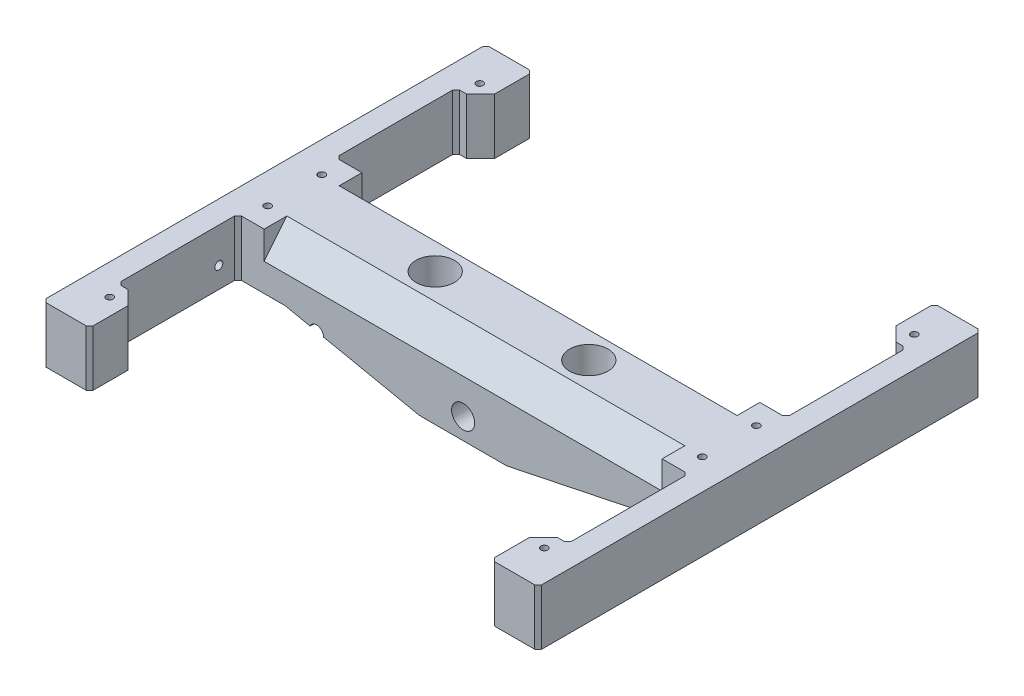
ISO-10303-21;
HEADER;
FILE_DESCRIPTION(('STEP AP214'),'2;1');
FILE_NAME('part.step','',(''),(''),'','','');
FILE_SCHEMA(('AUTOMOTIVE_DESIGN { 1 0 10303 214 1 1 1 1 }'));
ENDSEC;
DATA;
#1=APPLICATION_CONTEXT('core data for automotive mechanical design processes');
#2=APPLICATION_PROTOCOL_DEFINITION('international standard','automotive_design',2000,#1);
#3=PRODUCT_CONTEXT('',#1,'mechanical');
#4=PRODUCT('Part','Part','',(#3));
#5=PRODUCT_RELATED_PRODUCT_CATEGORY('part','',(#4));
#6=PRODUCT_DEFINITION_FORMATION('','',#4);
#7=PRODUCT_DEFINITION_CONTEXT('part definition',#1,'design');
#8=PRODUCT_DEFINITION('design','',#6,#7);
#9=PRODUCT_DEFINITION_SHAPE('','',#8);
#10=(LENGTH_UNIT() NAMED_UNIT(*) SI_UNIT(.MILLI.,.METRE.));
#11=(NAMED_UNIT(*) PLANE_ANGLE_UNIT() SI_UNIT($,.RADIAN.));
#12=(NAMED_UNIT(*) SI_UNIT($,.STERADIAN.) SOLID_ANGLE_UNIT());
#13=UNCERTAINTY_MEASURE_WITH_UNIT(LENGTH_MEASURE(1.E-05),#10,'distance_accuracy_value','');
#14=(GEOMETRIC_REPRESENTATION_CONTEXT(3) GLOBAL_UNCERTAINTY_ASSIGNED_CONTEXT((#13)) GLOBAL_UNIT_ASSIGNED_CONTEXT((#10,
#11,#12)) REPRESENTATION_CONTEXT('',''));
#15=CARTESIAN_POINT('',(0.,0.,0.));
#16=DIRECTION('',(0.,0.,1.));
#17=DIRECTION('',(1.,0.,0.));
#18=AXIS2_PLACEMENT_3D('',#15,#16,#17);
#19=CARTESIAN_POINT('',(-51.,-16.,-63.5));
#20=DIRECTION('',(0.203446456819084,0.97908607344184,0.));
#21=DIRECTION('',(-0.97908607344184,0.203446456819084,0.));
#22=AXIS2_PLACEMENT_3D('',#19,#20,#21);
#23=PLANE('',#22);
#24=CARTESIAN_POINT('',(-37.2587049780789,-18.8553340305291,10.5));
#25=DIRECTION('',(-0.203446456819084,-0.97908607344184,0.));
#26=DIRECTION('',(0.97908607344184,-0.203446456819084,0.));
#27=AXIS2_PLACEMENT_3D('',#24,#25,#26);
#28=CIRCLE('',#27,1.10000000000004);
#29=CARTESIAN_POINT('',(-36.1817102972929,-19.0791251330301,10.5));
#30=VERTEX_POINT('',#29);
#31=EDGE_CURVE('E1350',#30,#30,#28,.T.);
#32=ORIENTED_EDGE('',*,*,#31,.F.);
#33=EDGE_LOOP('',(#32));
#34=FACE_BOUND('',#33,.T.);
#35=DIRECTION('',(-0.97908607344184,0.203446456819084,0.));
#36=VECTOR('',#35,1.);
#37=CARTESIAN_POINT('',(-62.3476960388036,-13.6420371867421,14.));
#38=LINE('',#37,#36);
#39=CARTESIAN_POINT('',(-12.5,-24.,14.));
#40=VERTEX_POINT('',#39);
#41=CARTESIAN_POINT('',(-40.000145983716,-18.2856839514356,14.));
#42=VERTEX_POINT('',#41);
#43=EDGE_CURVE('E468',#40,#42,#38,.T.);
#44=ORIENTED_EDGE('',*,*,#43,.T.);
#45=DIRECTION('',(0.,0.,-1.));
#46=VECTOR('',#45,1.);
#47=CARTESIAN_POINT('',(-40.000145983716,-18.2856839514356,63.501));
#48=LINE('',#47,#46);
#49=CARTESIAN_POINT('',(-40.000145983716,-18.2856839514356,-14.));
#50=VERTEX_POINT('',#49);
#51=EDGE_CURVE('E455',#50,#42,#48,.F.);
#52=ORIENTED_EDGE('',*,*,#51,.F.);
#53=DIRECTION('',(0.97908607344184,-0.203446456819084,0.));
#54=VECTOR('',#53,1.);
#55=CARTESIAN_POINT('',(-62.3476960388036,-13.6420371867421,-14.));
#56=LINE('',#55,#54);
#57=CARTESIAN_POINT('',(-12.5,-24.,-14.));
#58=VERTEX_POINT('',#57);
#59=EDGE_CURVE('E465',#50,#58,#56,.T.);
#60=ORIENTED_EDGE('',*,*,#59,.T.);
#61=DIRECTION('',(0.,0.,-1.));
#62=VECTOR('',#61,1.);
#63=CARTESIAN_POINT('',(-12.5,-24.,0.));
#64=LINE('',#63,#62);
#65=CARTESIAN_POINT('',(-12.5,-24.,-9.5));
#66=VERTEX_POINT('',#65);
#67=EDGE_CURVE('E565',#66,#58,#64,.T.);
#68=ORIENTED_EDGE('',*,*,#67,.F.);
#69=DIRECTION('',(0.97908607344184,-0.203446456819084,0.));
#70=VECTOR('',#69,1.);
#71=CARTESIAN_POINT('',(-51.,-16.,-9.5));
#72=LINE('',#71,#70);
#73=CARTESIAN_POINT('',(-31.75,-20.,-9.5));
#74=VERTEX_POINT('',#73);
#75=EDGE_CURVE('E619',#66,#74,#72,.F.);
#76=ORIENTED_EDGE('',*,*,#75,.T.);
#77=DIRECTION('',(0.,0.,1.));
#78=VECTOR('',#77,1.);
#79=CARTESIAN_POINT('',(-31.75,-20.,-7.5));
#80=LINE('',#79,#78);
#81=CARTESIAN_POINT('',(-31.75,-20.,9.49999999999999));
#82=VERTEX_POINT('',#81);
#83=EDGE_CURVE('E579',#74,#82,#80,.T.);
#84=ORIENTED_EDGE('',*,*,#83,.T.);
#85=DIRECTION('',(0.97908607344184,-0.203446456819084,0.));
#86=VECTOR('',#85,1.);
#87=CARTESIAN_POINT('',(-12.5,-24.,9.49999999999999));
#88=LINE('',#87,#86);
#89=CARTESIAN_POINT('',(-12.5,-24.,9.49999999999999));
#90=VERTEX_POINT('',#89);
#91=EDGE_CURVE('E622',#82,#90,#88,.T.);
#92=ORIENTED_EDGE('',*,*,#91,.T.);
#93=EDGE_CURVE('E566',#40,#90,#64,.T.);
#94=ORIENTED_EDGE('',*,*,#93,.F.);
#95=EDGE_LOOP('',(#44,#52,#60,#68,#76,#84,#92,#94));
#96=FACE_BOUND('',#95,.T.);
#97=ADVANCED_FACE('F33',(#34,#96),#23,.F.);
#98=CARTESIAN_POINT('',(-64.5,-24.,14.));
#99=DIRECTION('',(0.,0.,-1.));
#100=DIRECTION('',(-1.,0.,0.));
#101=AXIS2_PLACEMENT_3D('',#98,#99,#100);
#102=PLANE('',#101);
#103=CARTESIAN_POINT('',(0.,-18.,14.));
#104=DIRECTION('',(0.,0.,-1.));
#105=DIRECTION('',(-1.,0.,0.));
#106=AXIS2_PLACEMENT_3D('',#103,#104,#105);
#107=CIRCLE('',#106,3.3);
#108=CARTESIAN_POINT('',(-3.3,-18.,14.));
#109=VERTEX_POINT('',#108);
#110=EDGE_CURVE('E570',#109,#109,#107,.F.);
#111=ORIENTED_EDGE('',*,*,#110,.F.);
#112=EDGE_LOOP('',(#111));
#113=FACE_BOUND('',#112,.T.);
#114=CARTESIAN_POINT('',(-43.843930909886,-17.4869753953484,14.));
#115=VERTEX_POINT('',#114);
#116=CARTESIAN_POINT('',(-51.,-16.,14.));
#117=VERTEX_POINT('',#116);
#118=EDGE_CURVE('E840',#115,#117,#38,.T.);
#119=ORIENTED_EDGE('',*,*,#118,.F.);
#120=CARTESIAN_POINT('',(-42.,-18.2615196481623,14.));
#121=DIRECTION('',(0.,0.,-1.));
#122=DIRECTION('',(-1.,0.,0.));
#123=AXIS2_PLACEMENT_3D('',#120,#121,#122);
#124=CIRCLE('',#123,2.);
#125=EDGE_CURVE('E48',#42,#115,#124,.F.);
#126=ORIENTED_EDGE('',*,*,#125,.F.);
#127=ORIENTED_EDGE('',*,*,#43,.F.);
#128=DIRECTION('',(-1.,0.,0.));
#129=VECTOR('',#128,1.);
#130=CARTESIAN_POINT('',(-64.5,-24.,14.));
#131=LINE('',#130,#129);
#132=CARTESIAN_POINT('',(12.5,-24.,14.));
#133=VERTEX_POINT('',#132);
#134=EDGE_CURVE('E856',#133,#40,#131,.T.);
#135=ORIENTED_EDGE('',*,*,#134,.F.);
#136=DIRECTION('',(-0.97908607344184,-0.203446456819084,0.));
#137=VECTOR('',#136,1.);
#138=CARTESIAN_POINT('',(-61.3129345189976,-39.3377526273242,14.));
#139=LINE('',#138,#137);
#140=CARTESIAN_POINT('',(51.,-16.,14.));
#141=VERTEX_POINT('',#140);
#142=EDGE_CURVE('E842',#141,#133,#139,.T.);
#143=ORIENTED_EDGE('',*,*,#142,.F.);
#144=DIRECTION('',(-1.,0.,0.));
#145=VECTOR('',#144,1.);
#146=CARTESIAN_POINT('',(-64.5,-16.,14.));
#147=LINE('',#146,#145);
#148=CARTESIAN_POINT('',(63.5,-16.,14.));
#149=VERTEX_POINT('',#148);
#150=EDGE_CURVE('E574',#149,#141,#147,.T.);
#151=ORIENTED_EDGE('',*,*,#150,.F.);
#152=DIRECTION('',(0.,1.,0.));
#153=VECTOR('',#152,1.);
#154=CARTESIAN_POINT('',(63.5,0.,14.));
#155=LINE('',#154,#153);
#156=CARTESIAN_POINT('',(63.5,0.,14.));
#157=VERTEX_POINT('',#156);
#158=EDGE_CURVE('E701',#149,#157,#155,.T.);
#159=ORIENTED_EDGE('',*,*,#158,.T.);
#160=DIRECTION('',(-1.,0.,0.));
#161=VECTOR('',#160,1.);
#162=CARTESIAN_POINT('',(-64.5,0.,14.));
#163=LINE('',#162,#161);
#164=CARTESIAN_POINT('',(57.,0.,14.));
#165=VERTEX_POINT('',#164);
#166=EDGE_CURVE('E870',#157,#165,#163,.T.);
#167=ORIENTED_EDGE('',*,*,#166,.T.);
#168=DIRECTION('',(0.,-1.,0.));
#169=VECTOR('',#168,1.);
#170=CARTESIAN_POINT('',(57.,-8.,14.));
#171=LINE('',#170,#169);
#172=CARTESIAN_POINT('',(57.,-8.,14.));
#173=VERTEX_POINT('',#172);
#174=EDGE_CURVE('E1169',#165,#173,#171,.T.);
#175=ORIENTED_EDGE('',*,*,#174,.T.);
#176=DIRECTION('',(1.,0.,0.));
#177=VECTOR('',#176,1.);
#178=CARTESIAN_POINT('',(-57.,-8.,14.));
#179=LINE('',#178,#177);
#180=CARTESIAN_POINT('',(-57.,-8.,14.));
#181=VERTEX_POINT('',#180);
#182=EDGE_CURVE('E1156',#181,#173,#179,.T.);
#183=ORIENTED_EDGE('',*,*,#182,.F.);
#184=DIRECTION('',(0.,-1.,0.));
#185=VECTOR('',#184,1.);
#186=CARTESIAN_POINT('',(-57.,-8.,14.));
#187=LINE('',#186,#185);
#188=CARTESIAN_POINT('',(-57.,0.,14.));
#189=VERTEX_POINT('',#188);
#190=EDGE_CURVE('E1155',#189,#181,#187,.T.);
#191=ORIENTED_EDGE('',*,*,#190,.F.);
#192=CARTESIAN_POINT('',(-63.5,0.,14.));
#193=VERTEX_POINT('',#192);
#194=EDGE_CURVE('E815',#189,#193,#163,.T.);
#195=ORIENTED_EDGE('',*,*,#194,.T.);
#196=DIRECTION('',(0.,-1.,0.));
#197=VECTOR('',#196,1.);
#198=CARTESIAN_POINT('',(-63.5,-16.,14.));
#199=LINE('',#198,#197);
#200=CARTESIAN_POINT('',(-63.5,-16.,14.));
#201=VERTEX_POINT('',#200);
#202=EDGE_CURVE('E699',#193,#201,#199,.T.);
#203=ORIENTED_EDGE('',*,*,#202,.T.);
#204=DIRECTION('',(-1.,0.,0.));
#205=VECTOR('',#204,1.);
#206=CARTESIAN_POINT('',(-64.5,-16.,14.));
#207=LINE('',#206,#205);
#208=EDGE_CURVE('E835',#117,#201,#207,.T.);
#209=ORIENTED_EDGE('',*,*,#208,.F.);
#210=EDGE_LOOP('',(#119,#126,#127,#135,#143,#151,#159,#167,#175,#183,#191,#195,#203,#209));
#211=FACE_BOUND('',#210,.T.);
#212=ADVANCED_FACE('F966',(#113,#211),#102,.F.);
#213=CARTESIAN_POINT('',(0.,0.,0.));
#214=DIRECTION('',(0.,1.,0.));
#215=DIRECTION('',(0.,0.,1.));
#216=AXIS2_PLACEMENT_3D('',#213,#214,#215);
#217=PLANE('',#216);
#218=CARTESIAN_POINT('',(-62.25,0.,-7.74999999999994));
#219=DIRECTION('',(0.,1.,0.));
#220=DIRECTION('',(0.,0.,1.));
#221=AXIS2_PLACEMENT_3D('',#218,#219,#220);
#222=CIRCLE('',#221,0.999999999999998);
#223=CARTESIAN_POINT('',(-62.25,0.,-6.74999999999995));
#224=VERTEX_POINT('',#223);
#225=EDGE_CURVE('E1241',#224,#224,#222,.T.);
#226=ORIENTED_EDGE('',*,*,#225,.F.);
#227=EDGE_LOOP('',(#226));
#228=FACE_BOUND('',#227,.T.);
#229=CARTESIAN_POINT('',(-62.25,0.,7.75));
#230=DIRECTION('',(0.,1.,0.));
#231=DIRECTION('',(0.,0.,1.));
#232=AXIS2_PLACEMENT_3D('',#229,#230,#231);
#233=CIRCLE('',#232,0.999999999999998);
#234=CARTESIAN_POINT('',(-62.25,0.,8.75));
#235=VERTEX_POINT('',#234);
#236=EDGE_CURVE('E1247',#235,#235,#233,.T.);
#237=ORIENTED_EDGE('',*,*,#236,.F.);
#238=EDGE_LOOP('',(#237));
#239=FACE_BOUND('',#238,.T.);
#240=CARTESIAN_POINT('',(-62.25,0.,53.));
#241=DIRECTION('',(0.,1.,0.));
#242=DIRECTION('',(0.,0.,1.));
#243=AXIS2_PLACEMENT_3D('',#240,#241,#242);
#244=CIRCLE('',#243,0.999999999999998);
#245=CARTESIAN_POINT('',(-62.25,0.,54.));
#246=VERTEX_POINT('',#245);
#247=EDGE_CURVE('E1253',#246,#246,#244,.T.);
#248=ORIENTED_EDGE('',*,*,#247,.F.);
#249=EDGE_LOOP('',(#248));
#250=FACE_BOUND('',#249,.T.);
#251=CARTESIAN_POINT('',(62.25,0.,53.));
#252=DIRECTION('',(0.,1.,0.));
#253=DIRECTION('',(0.,0.,1.));
#254=AXIS2_PLACEMENT_3D('',#251,#252,#253);
#255=CIRCLE('',#254,0.999999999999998);
#256=CARTESIAN_POINT('',(62.25,0.,54.));
#257=VERTEX_POINT('',#256);
#258=EDGE_CURVE('E1222',#257,#257,#255,.T.);
#259=ORIENTED_EDGE('',*,*,#258,.F.);
#260=EDGE_LOOP('',(#259));
#261=FACE_BOUND('',#260,.T.);
#262=CARTESIAN_POINT('',(62.25,0.,7.74999999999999));
#263=DIRECTION('',(0.,1.,0.));
#264=DIRECTION('',(0.,0.,1.));
#265=AXIS2_PLACEMENT_3D('',#262,#263,#264);
#266=CIRCLE('',#265,0.999999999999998);
#267=CARTESIAN_POINT('',(62.25,0.,8.74999999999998));
#268=VERTEX_POINT('',#267);
#269=EDGE_CURVE('E1223',#268,#268,#266,.T.);
#270=ORIENTED_EDGE('',*,*,#269,.F.);
#271=EDGE_LOOP('',(#270));
#272=FACE_BOUND('',#271,.T.);
#273=CARTESIAN_POINT('',(62.25,0.,-7.74999999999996));
#274=DIRECTION('',(0.,1.,0.));
#275=DIRECTION('',(0.,0.,1.));
#276=AXIS2_PLACEMENT_3D('',#273,#274,#275);
#277=CIRCLE('',#276,0.999999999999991);
#278=CARTESIAN_POINT('',(62.25,0.,-6.74999999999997));
#279=VERTEX_POINT('',#278);
#280=EDGE_CURVE('E1229',#279,#279,#277,.T.);
#281=ORIENTED_EDGE('',*,*,#280,.F.);
#282=EDGE_LOOP('',(#281));
#283=FACE_BOUND('',#282,.T.);
#284=CARTESIAN_POINT('',(62.25,0.,-53.));
#285=DIRECTION('',(0.,1.,0.));
#286=DIRECTION('',(0.,0.,1.));
#287=AXIS2_PLACEMENT_3D('',#284,#285,#286);
#288=CIRCLE('',#287,0.999999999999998);
#289=CARTESIAN_POINT('',(62.25,0.,-52.));
#290=VERTEX_POINT('',#289);
#291=EDGE_CURVE('E1205',#290,#290,#288,.T.);
#292=ORIENTED_EDGE('',*,*,#291,.F.);
#293=EDGE_LOOP('',(#292));
#294=FACE_BOUND('',#293,.T.);
#295=CARTESIAN_POINT('',(-62.25,0.,-53.));
#296=DIRECTION('',(0.,1.,0.));
#297=DIRECTION('',(0.,0.,1.));
#298=AXIS2_PLACEMENT_3D('',#295,#296,#297);
#299=CIRCLE('',#298,0.999999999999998);
#300=CARTESIAN_POINT('',(-62.25,0.,-52.));
#301=VERTEX_POINT('',#300);
#302=EDGE_CURVE('E1240',#301,#301,#299,.T.);
#303=ORIENTED_EDGE('',*,*,#302,.F.);
#304=EDGE_LOOP('',(#303));
#305=FACE_BOUND('',#304,.T.);
#306=CARTESIAN_POINT('',(-22.,0.,0.));
#307=DIRECTION('',(0.,1.,0.));
#308=DIRECTION('',(0.,0.,1.));
#309=AXIS2_PLACEMENT_3D('',#306,#307,#308);
#310=CIRCLE('',#309,5.5);
#311=CARTESIAN_POINT('',(-22.,0.,5.5));
#312=VERTEX_POINT('',#311);
#313=EDGE_CURVE('E587',#312,#312,#310,.T.);
#314=ORIENTED_EDGE('',*,*,#313,.F.);
#315=EDGE_LOOP('',(#314));
#316=FACE_BOUND('',#315,.T.);
#317=CARTESIAN_POINT('',(22.,0.,0.));
#318=DIRECTION('',(0.,1.,0.));
#319=DIRECTION('',(0.,0.,1.));
#320=AXIS2_PLACEMENT_3D('',#317,#318,#319);
#321=CIRCLE('',#320,5.5);
#322=CARTESIAN_POINT('',(22.,0.,5.5));
#323=VERTEX_POINT('',#322);
#324=EDGE_CURVE('E1264',#323,#323,#321,.T.);
#325=ORIENTED_EDGE('',*,*,#324,.F.);
#326=EDGE_LOOP('',(#325));
#327=FACE_BOUND('',#326,.T.);
#328=ORIENTED_EDGE('',*,*,#194,.F.);
#329=DIRECTION('',(0.,0.,1.));
#330=VECTOR('',#329,1.);
#331=CARTESIAN_POINT('',(-57.,0.,14.));
#332=LINE('',#331,#330);
#333=CARTESIAN_POINT('',(-57.,0.,7.50000000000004));
#334=VERTEX_POINT('',#333);
#335=EDGE_CURVE('E1152',#334,#189,#332,.T.);
#336=ORIENTED_EDGE('',*,*,#335,.F.);
#337=DIRECTION('',(1.,0.,0.));
#338=VECTOR('',#337,1.);
#339=CARTESIAN_POINT('',(-57.,0.,7.50000000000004));
#340=LINE('',#339,#338);
#341=CARTESIAN_POINT('',(57.,0.,7.50000000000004));
#342=VERTEX_POINT('',#341);
#343=EDGE_CURVE('E656',#334,#342,#340,.T.);
#344=ORIENTED_EDGE('',*,*,#343,.T.);
#345=DIRECTION('',(0.,0.,1.));
#346=VECTOR('',#345,1.);
#347=CARTESIAN_POINT('',(57.,0.,14.));
#348=LINE('',#347,#346);
#349=EDGE_CURVE('E1167',#342,#165,#348,.T.);
#350=ORIENTED_EDGE('',*,*,#349,.T.);
#351=ORIENTED_EDGE('',*,*,#166,.F.);
#352=DIRECTION('',(-0.707106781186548,0.,-0.707106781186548));
#353=VECTOR('',#352,1.);
#354=CARTESIAN_POINT('',(63.5,0.,14.));
#355=LINE('',#354,#353);
#356=CARTESIAN_POINT('',(64.5,0.,15.));
#357=VERTEX_POINT('',#356);
#358=EDGE_CURVE('E774',#157,#357,#355,.F.);
#359=ORIENTED_EDGE('',*,*,#358,.T.);
#360=DIRECTION('',(0.,0.,-1.));
#361=VECTOR('',#360,1.);
#362=CARTESIAN_POINT('',(64.5,0.,14.));
#363=LINE('',#362,#361);
#364=CARTESIAN_POINT('',(64.5,0.,47.5));
#365=VERTEX_POINT('',#364);
#366=EDGE_CURVE('E873',#365,#357,#363,.T.);
#367=ORIENTED_EDGE('',*,*,#366,.F.);
#368=DIRECTION('',(0.707106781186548,0.,-0.707106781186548));
#369=VECTOR('',#368,1.);
#370=CARTESIAN_POINT('',(64.5,0.,47.5));
#371=LINE('',#370,#369);
#372=CARTESIAN_POINT('',(63.4999999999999,0.,48.5));
#373=VERTEX_POINT('',#372);
#374=EDGE_CURVE('E770',#365,#373,#371,.F.);
#375=ORIENTED_EDGE('',*,*,#374,.T.);
#376=DIRECTION('',(1.,0.,0.));
#377=VECTOR('',#376,1.);
#378=CARTESIAN_POINT('',(61.5,0.,48.5));
#379=LINE('',#378,#377);
#380=CARTESIAN_POINT('',(61.5,0.,48.5));
#381=VERTEX_POINT('',#380);
#382=EDGE_CURVE('E876',#381,#373,#379,.T.);
#383=ORIENTED_EDGE('',*,*,#382,.F.);
#384=DIRECTION('',(0.707106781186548,0.,-0.707106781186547));
#385=VECTOR('',#384,1.);
#386=CARTESIAN_POINT('',(57.5,0.,52.5));
#387=LINE('',#386,#385);
#388=CARTESIAN_POINT('',(57.5,0.,52.5));
#389=VERTEX_POINT('',#388);
#390=EDGE_CURVE('E879',#389,#381,#387,.T.);
#391=ORIENTED_EDGE('',*,*,#390,.F.);
#392=DIRECTION('',(0.,0.,-1.));
#393=VECTOR('',#392,1.);
#394=CARTESIAN_POINT('',(57.5,0.,63.5));
#395=LINE('',#394,#393);
#396=CARTESIAN_POINT('',(57.5,0.,62.5000000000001));
#397=VERTEX_POINT('',#396);
#398=EDGE_CURVE('E882',#397,#389,#395,.T.);
#399=ORIENTED_EDGE('',*,*,#398,.F.);
#400=DIRECTION('',(-0.707106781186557,0.,-0.707106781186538));
#401=VECTOR('',#400,1.);
#402=CARTESIAN_POINT('',(-2.50000000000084,0.,2.50000000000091));
#403=LINE('',#402,#401);
#404=CARTESIAN_POINT('',(58.5,0.,63.5));
#405=VERTEX_POINT('',#404);
#406=EDGE_CURVE('E673',#397,#405,#403,.F.);
#407=ORIENTED_EDGE('',*,*,#406,.T.);
#408=DIRECTION('',(-1.,0.,0.));
#409=VECTOR('',#408,1.);
#410=CARTESIAN_POINT('',(57.5,0.,63.5));
#411=LINE('',#410,#409);
#412=CARTESIAN_POINT('',(70.,0.,63.5));
#413=VERTEX_POINT('',#412);
#414=EDGE_CURVE('E860',#413,#405,#411,.T.);
#415=ORIENTED_EDGE('',*,*,#414,.F.);
#416=DIRECTION('',(0.707106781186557,0.,-0.707106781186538));
#417=VECTOR('',#416,1.);
#418=CARTESIAN_POINT('',(66.749999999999,0.,66.7500000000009));
#419=LINE('',#418,#417);
#420=CARTESIAN_POINT('',(71.,0.,62.5));
#421=VERTEX_POINT('',#420);
#422=EDGE_CURVE('E675',#413,#421,#419,.T.);
#423=ORIENTED_EDGE('',*,*,#422,.T.);
#424=DIRECTION('',(0.,0.,-1.));
#425=VECTOR('',#424,1.);
#426=CARTESIAN_POINT('',(71.,0.,-63.5));
#427=LINE('',#426,#425);
#428=CARTESIAN_POINT('',(71.,0.,-62.5));
#429=VERTEX_POINT('',#428);
#430=EDGE_CURVE('E521',#421,#429,#427,.T.);
#431=ORIENTED_EDGE('',*,*,#430,.T.);
#432=DIRECTION('',(0.707106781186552,0.,0.707106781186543));
#433=VECTOR('',#432,1.);
#434=CARTESIAN_POINT('',(66.7499999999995,0.,-66.7500000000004));
#435=LINE('',#434,#433);
#436=CARTESIAN_POINT('',(70.,0.,-63.5));
#437=VERTEX_POINT('',#436);
#438=EDGE_CURVE('E677',#429,#437,#435,.F.);
#439=ORIENTED_EDGE('',*,*,#438,.T.);
#440=DIRECTION('',(-1.,0.,0.));
#441=VECTOR('',#440,1.);
#442=CARTESIAN_POINT('',(57.5,0.,-63.5));
#443=LINE('',#442,#441);
#444=CARTESIAN_POINT('',(58.4999999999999,0.,-63.5));
#445=VERTEX_POINT('',#444);
#446=EDGE_CURVE('E524',#437,#445,#443,.T.);
#447=ORIENTED_EDGE('',*,*,#446,.T.);
#448=DIRECTION('',(0.707106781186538,0.,-0.707106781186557));
#449=VECTOR('',#448,1.);
#450=CARTESIAN_POINT('',(-2.49999999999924,0.,-2.49999999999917));
#451=LINE('',#450,#449);
#452=CARTESIAN_POINT('',(57.5,0.,-62.5));
#453=VERTEX_POINT('',#452);
#454=EDGE_CURVE('E665',#445,#453,#451,.F.);
#455=ORIENTED_EDGE('',*,*,#454,.T.);
#456=DIRECTION('',(0.,0.,1.));
#457=VECTOR('',#456,1.);
#458=CARTESIAN_POINT('',(57.5,0.,-63.5));
#459=LINE('',#458,#457);
#460=CARTESIAN_POINT('',(57.5,0.,-52.5));
#461=VERTEX_POINT('',#460);
#462=EDGE_CURVE('E527',#453,#461,#459,.T.);
#463=ORIENTED_EDGE('',*,*,#462,.T.);
#464=DIRECTION('',(0.707106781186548,0.,0.707106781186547));
#465=VECTOR('',#464,1.);
#466=CARTESIAN_POINT('',(57.5,0.,-52.5));
#467=LINE('',#466,#465);
#468=CARTESIAN_POINT('',(61.5,0.,-48.5));
#469=VERTEX_POINT('',#468);
#470=EDGE_CURVE('E529',#461,#469,#467,.T.);
#471=ORIENTED_EDGE('',*,*,#470,.T.);
#472=DIRECTION('',(1.,0.,0.));
#473=VECTOR('',#472,1.);
#474=CARTESIAN_POINT('',(61.5,0.,-48.5));
#475=LINE('',#474,#473);
#476=CARTESIAN_POINT('',(63.5,0.,-48.5));
#477=VERTEX_POINT('',#476);
#478=EDGE_CURVE('E532',#469,#477,#475,.T.);
#479=ORIENTED_EDGE('',*,*,#478,.T.);
#480=DIRECTION('',(-0.707106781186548,0.,-0.707106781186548));
#481=VECTOR('',#480,1.);
#482=CARTESIAN_POINT('',(63.5,0.,-48.5));
#483=LINE('',#482,#481);
#484=CARTESIAN_POINT('',(64.5,0.,-47.5));
#485=VERTEX_POINT('',#484);
#486=EDGE_CURVE('E778',#477,#485,#483,.F.);
#487=ORIENTED_EDGE('',*,*,#486,.T.);
#488=DIRECTION('',(0.,0.,1.));
#489=VECTOR('',#488,1.);
#490=CARTESIAN_POINT('',(64.5,0.,-14.));
#491=LINE('',#490,#489);
#492=CARTESIAN_POINT('',(64.5,0.,-15.));
#493=VERTEX_POINT('',#492);
#494=EDGE_CURVE('E535',#485,#493,#491,.T.);
#495=ORIENTED_EDGE('',*,*,#494,.T.);
#496=DIRECTION('',(0.707106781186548,0.,-0.707106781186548));
#497=VECTOR('',#496,1.);
#498=CARTESIAN_POINT('',(64.5,0.,-15.));
#499=LINE('',#498,#497);
#500=CARTESIAN_POINT('',(63.5,0.,-14.));
#501=VERTEX_POINT('',#500);
#502=EDGE_CURVE('E782',#493,#501,#499,.F.);
#503=ORIENTED_EDGE('',*,*,#502,.T.);
#504=DIRECTION('',(-1.,0.,0.));
#505=VECTOR('',#504,1.);
#506=CARTESIAN_POINT('',(-64.5,0.,-14.));
#507=LINE('',#506,#505);
#508=CARTESIAN_POINT('',(57.,0.,-14.));
#509=VERTEX_POINT('',#508);
#510=EDGE_CURVE('E539',#501,#509,#507,.T.);
#511=ORIENTED_EDGE('',*,*,#510,.T.);
#512=DIRECTION('',(0.,0.,1.));
#513=VECTOR('',#512,1.);
#514=CARTESIAN_POINT('',(57.,0.,-7.50000000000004));
#515=LINE('',#514,#513);
#516=CARTESIAN_POINT('',(57.,0.,-7.50000000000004));
#517=VERTEX_POINT('',#516);
#518=EDGE_CURVE('E1186',#509,#517,#515,.T.);
#519=ORIENTED_EDGE('',*,*,#518,.T.);
#520=DIRECTION('',(1.,0.,0.));
#521=VECTOR('',#520,1.);
#522=CARTESIAN_POINT('',(-57.,0.,-7.50000000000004));
#523=LINE('',#522,#521);
#524=CARTESIAN_POINT('',(-57.,0.,-7.50000000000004));
#525=VERTEX_POINT('',#524);
#526=EDGE_CURVE('E1185',#525,#517,#523,.T.);
#527=ORIENTED_EDGE('',*,*,#526,.F.);
#528=DIRECTION('',(0.,0.,1.));
#529=VECTOR('',#528,1.);
#530=CARTESIAN_POINT('',(-57.,0.,-7.50000000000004));
#531=LINE('',#530,#529);
#532=CARTESIAN_POINT('',(-57.,0.,-14.));
#533=VERTEX_POINT('',#532);
#534=EDGE_CURVE('E1176',#533,#525,#531,.T.);
#535=ORIENTED_EDGE('',*,*,#534,.F.);
#536=CARTESIAN_POINT('',(-63.5,0.,-14.));
#537=VERTEX_POINT('',#536);
#538=EDGE_CURVE('E538',#533,#537,#507,.T.);
#539=ORIENTED_EDGE('',*,*,#538,.T.);
#540=DIRECTION('',(0.707106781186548,0.,0.707106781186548));
#541=VECTOR('',#540,1.);
#542=CARTESIAN_POINT('',(-63.5,0.,-14.));
#543=LINE('',#542,#541);
#544=CARTESIAN_POINT('',(-64.5,0.,-15.));
#545=VERTEX_POINT('',#544);
#546=EDGE_CURVE('E786',#537,#545,#543,.F.);
#547=ORIENTED_EDGE('',*,*,#546,.T.);
#548=DIRECTION('',(0.,0.,-1.));
#549=VECTOR('',#548,1.);
#550=CARTESIAN_POINT('',(-64.5,0.,-14.));
#551=LINE('',#550,#549);
#552=CARTESIAN_POINT('',(-64.5,0.,-47.5));
#553=VERTEX_POINT('',#552);
#554=EDGE_CURVE('E542',#545,#553,#551,.T.);
#555=ORIENTED_EDGE('',*,*,#554,.T.);
#556=DIRECTION('',(-0.707106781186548,0.,0.707106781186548));
#557=VECTOR('',#556,1.);
#558=CARTESIAN_POINT('',(-64.5,0.,-47.5));
#559=LINE('',#558,#557);
#560=CARTESIAN_POINT('',(-63.4999999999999,0.,-48.5));
#561=VERTEX_POINT('',#560);
#562=EDGE_CURVE('E790',#553,#561,#559,.F.);
#563=ORIENTED_EDGE('',*,*,#562,.T.);
#564=DIRECTION('',(1.,0.,0.));
#565=VECTOR('',#564,1.);
#566=CARTESIAN_POINT('',(-61.5,0.,-48.5));
#567=LINE('',#566,#565);
#568=CARTESIAN_POINT('',(-61.5,0.,-48.5));
#569=VERTEX_POINT('',#568);
#570=EDGE_CURVE('E545',#561,#569,#567,.T.);
#571=ORIENTED_EDGE('',*,*,#570,.T.);
#572=DIRECTION('',(0.707106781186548,0.,-0.707106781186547));
#573=VECTOR('',#572,1.);
#574=CARTESIAN_POINT('',(-57.5,0.,-52.5));
#575=LINE('',#574,#573);
#576=CARTESIAN_POINT('',(-57.5,0.,-52.5));
#577=VERTEX_POINT('',#576);
#578=EDGE_CURVE('E547',#569,#577,#575,.T.);
#579=ORIENTED_EDGE('',*,*,#578,.T.);
#580=DIRECTION('',(0.,0.,-1.));
#581=VECTOR('',#580,1.);
#582=CARTESIAN_POINT('',(-57.5,0.,-63.5));
#583=LINE('',#582,#581);
#584=CARTESIAN_POINT('',(-57.5,0.,-62.5000000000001));
#585=VERTEX_POINT('',#584);
#586=EDGE_CURVE('E515',#577,#585,#583,.T.);
#587=ORIENTED_EDGE('',*,*,#586,.T.);
#588=DIRECTION('',(0.707106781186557,0.,0.707106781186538));
#589=VECTOR('',#588,1.);
#590=CARTESIAN_POINT('',(2.50000000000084,0.,-2.50000000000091));
#591=LINE('',#590,#589);
#592=CARTESIAN_POINT('',(-58.5,0.,-63.5));
#593=VERTEX_POINT('',#592);
#594=EDGE_CURVE('E667',#585,#593,#591,.F.);
#595=ORIENTED_EDGE('',*,*,#594,.T.);
#596=DIRECTION('',(-1.,0.,0.));
#597=VECTOR('',#596,1.);
#598=CARTESIAN_POINT('',(-57.5,0.,-63.5));
#599=LINE('',#598,#597);
#600=CARTESIAN_POINT('',(-70.,0.,-63.5));
#601=VERTEX_POINT('',#600);
#602=EDGE_CURVE('E512',#593,#601,#599,.T.);
#603=ORIENTED_EDGE('',*,*,#602,.T.);
#604=DIRECTION('',(0.707106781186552,0.,-0.707106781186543));
#605=VECTOR('',#604,1.);
#606=CARTESIAN_POINT('',(-66.7499999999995,0.,-66.7500000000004));
#607=LINE('',#606,#605);
#608=CARTESIAN_POINT('',(-71.,0.,-62.5));
#609=VERTEX_POINT('',#608);
#610=EDGE_CURVE('E663',#601,#609,#607,.F.);
#611=ORIENTED_EDGE('',*,*,#610,.T.);
#612=DIRECTION('',(0.,0.,1.));
#613=VECTOR('',#612,1.);
#614=CARTESIAN_POINT('',(-71.,0.,-63.5));
#615=LINE('',#614,#613);
#616=CARTESIAN_POINT('',(-71.,0.,62.4999999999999));
#617=VERTEX_POINT('',#616);
#618=EDGE_CURVE('E518',#609,#617,#615,.T.);
#619=ORIENTED_EDGE('',*,*,#618,.T.);
#620=DIRECTION('',(0.707106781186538,0.,0.707106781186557));
#621=VECTOR('',#620,1.);
#622=CARTESIAN_POINT('',(-66.750000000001,0.,66.7499999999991));
#623=LINE('',#622,#621);
#624=CARTESIAN_POINT('',(-70.,0.,63.5));
#625=VERTEX_POINT('',#624);
#626=EDGE_CURVE('E669',#617,#625,#623,.T.);
#627=ORIENTED_EDGE('',*,*,#626,.T.);
#628=DIRECTION('',(-1.,0.,0.));
#629=VECTOR('',#628,1.);
#630=CARTESIAN_POINT('',(-57.5,0.,63.5));
#631=LINE('',#630,#629);
#632=CARTESIAN_POINT('',(-58.4999999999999,0.,63.5));
#633=VERTEX_POINT('',#632);
#634=EDGE_CURVE('E573',#633,#625,#631,.T.);
#635=ORIENTED_EDGE('',*,*,#634,.F.);
#636=DIRECTION('',(-0.707106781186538,0.,0.707106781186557));
#637=VECTOR('',#636,1.);
#638=CARTESIAN_POINT('',(2.49999999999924,0.,2.49999999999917));
#639=LINE('',#638,#637);
#640=CARTESIAN_POINT('',(-57.5,0.,62.5));
#641=VERTEX_POINT('',#640);
#642=EDGE_CURVE('E671',#633,#641,#639,.F.);
#643=ORIENTED_EDGE('',*,*,#642,.T.);
#644=DIRECTION('',(0.,0.,1.));
#645=VECTOR('',#644,1.);
#646=CARTESIAN_POINT('',(-57.5,0.,63.5));
#647=LINE('',#646,#645);
#648=CARTESIAN_POINT('',(-57.5,0.,52.5));
#649=VERTEX_POINT('',#648);
#650=EDGE_CURVE('E863',#649,#641,#647,.T.);
#651=ORIENTED_EDGE('',*,*,#650,.F.);
#652=DIRECTION('',(0.707106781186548,0.,0.707106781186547));
#653=VECTOR('',#652,1.);
#654=CARTESIAN_POINT('',(-57.5,0.,52.5));
#655=LINE('',#654,#653);
#656=CARTESIAN_POINT('',(-61.5,0.,48.5));
#657=VERTEX_POINT('',#656);
#658=EDGE_CURVE('E866',#657,#649,#655,.T.);
#659=ORIENTED_EDGE('',*,*,#658,.F.);
#660=DIRECTION('',(1.,0.,0.));
#661=VECTOR('',#660,1.);
#662=CARTESIAN_POINT('',(-61.5,0.,48.5));
#663=LINE('',#662,#661);
#664=CARTESIAN_POINT('',(-63.5,0.,48.5));
#665=VERTEX_POINT('',#664);
#666=EDGE_CURVE('E806',#665,#657,#663,.T.);
#667=ORIENTED_EDGE('',*,*,#666,.F.);
#668=DIRECTION('',(0.707106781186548,0.,0.707106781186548));
#669=VECTOR('',#668,1.);
#670=CARTESIAN_POINT('',(-63.5,0.,48.5));
#671=LINE('',#670,#669);
#672=CARTESIAN_POINT('',(-64.5,0.,47.5));
#673=VERTEX_POINT('',#672);
#674=EDGE_CURVE('E41',#665,#673,#671,.F.);
#675=ORIENTED_EDGE('',*,*,#674,.T.);
#676=DIRECTION('',(0.,0.,1.));
#677=VECTOR('',#676,1.);
#678=CARTESIAN_POINT('',(-64.5,0.,14.));
#679=LINE('',#678,#677);
#680=CARTESIAN_POINT('',(-64.5,0.,15.));
#681=VERTEX_POINT('',#680);
#682=EDGE_CURVE('E804',#681,#673,#679,.T.);
#683=ORIENTED_EDGE('',*,*,#682,.F.);
#684=DIRECTION('',(-0.707106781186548,0.,0.707106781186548));
#685=VECTOR('',#684,1.);
#686=CARTESIAN_POINT('',(-64.5,0.,15.));
#687=LINE('',#686,#685);
#688=EDGE_CURVE('E794',#681,#193,#687,.F.);
#689=ORIENTED_EDGE('',*,*,#688,.T.);
#690=EDGE_LOOP('',(#328,#336,#344,#350,#351,#359,#367,#375,#383,#391,#399,#407,#415,#423,#431,
#439,#447,#455,#463,#471,#479,#487,#495,#503,#511,#519,#527,#535,#539,#547,#555,#563,#571,#579,
#587,#595,#603,#611,#619,#627,#635,#643,#651,#659,#667,#675,#683,#689));
#691=FACE_BOUND('',#690,.T.);
#692=ADVANCED_FACE('F803',(#228,#239,#250,#261,#272,#283,#294,#305,#316,#327,#691),#217,.T.);
#693=CARTESIAN_POINT('',(12.5,-24.,-63.5));
#694=DIRECTION('',(-0.203446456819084,0.97908607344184,0.));
#695=DIRECTION('',(-0.97908607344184,-0.203446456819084,0.));
#696=AXIS2_PLACEMENT_3D('',#693,#694,#695);
#697=PLANE('',#696);
#698=DIRECTION('',(0.,0.,1.));
#699=VECTOR('',#698,1.);
#700=CARTESIAN_POINT('',(12.5,-24.,0.));
#701=LINE('',#700,#699);
#702=CARTESIAN_POINT('',(12.5,-24.,9.5));
#703=VERTEX_POINT('',#702);
#704=EDGE_CURVE('E554',#703,#133,#701,.T.);
#705=ORIENTED_EDGE('',*,*,#704,.F.);
#706=DIRECTION('',(0.97908607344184,0.203446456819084,0.));
#707=VECTOR('',#706,1.);
#708=CARTESIAN_POINT('',(31.75,-20.,9.49999999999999));
#709=LINE('',#708,#707);
#710=CARTESIAN_POINT('',(31.75,-20.,9.49999999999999));
#711=VERTEX_POINT('',#710);
#712=EDGE_CURVE('E608',#703,#711,#709,.T.);
#713=ORIENTED_EDGE('',*,*,#712,.T.);
#714=DIRECTION('',(0.,0.,1.));
#715=VECTOR('',#714,1.);
#716=CARTESIAN_POINT('',(31.75,-20.,-7.5));
#717=LINE('',#716,#715);
#718=CARTESIAN_POINT('',(31.75,-20.,-7.5));
#719=VERTEX_POINT('',#718);
#720=EDGE_CURVE('E1142',#719,#711,#717,.T.);
#721=ORIENTED_EDGE('',*,*,#720,.F.);
#722=DIRECTION('',(0.,0.,-1.));
#723=VECTOR('',#722,1.);
#724=CARTESIAN_POINT('',(31.75,-20.,5.82239247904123));
#725=LINE('',#724,#723);
#726=CARTESIAN_POINT('',(31.75,-20.,-14.));
#727=VERTEX_POINT('',#726);
#728=EDGE_CURVE('E979',#719,#727,#725,.T.);
#729=ORIENTED_EDGE('',*,*,#728,.T.);
#730=DIRECTION('',(0.97908607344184,0.203446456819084,0.));
#731=VECTOR('',#730,1.);
#732=CARTESIAN_POINT('',(-61.3129345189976,-39.3377526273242,-14.));
#733=LINE('',#732,#731);
#734=CARTESIAN_POINT('',(51.,-16.,-14.));
#735=VERTEX_POINT('',#734);
#736=EDGE_CURVE('E481',#727,#735,#733,.T.);
#737=ORIENTED_EDGE('',*,*,#736,.T.);
#738=DIRECTION('',(0.,0.,1.));
#739=VECTOR('',#738,1.);
#740=CARTESIAN_POINT('',(51.,-16.,-63.5));
#741=LINE('',#740,#739);
#742=EDGE_CURVE('E906',#735,#141,#741,.T.);
#743=ORIENTED_EDGE('',*,*,#742,.T.);
#744=ORIENTED_EDGE('',*,*,#142,.T.);
#745=EDGE_LOOP('',(#705,#713,#721,#729,#737,#743,#744));
#746=FACE_BOUND('',#745,.T.);
#747=ADVANCED_FACE('F974',(#746),#697,.F.);
#748=CARTESIAN_POINT('',(0.,-24.,0.));
#749=DIRECTION('',(0.,1.,0.));
#750=DIRECTION('',(0.,0.,1.));
#751=AXIS2_PLACEMENT_3D('',#748,#749,#750);
#752=PLANE('',#751);
#753=ORIENTED_EDGE('',*,*,#93,.T.);
#754=DIRECTION('',(1.,0.,0.));
#755=VECTOR('',#754,1.);
#756=CARTESIAN_POINT('',(12.5,-24.,9.5));
#757=LINE('',#756,#755);
#758=EDGE_CURVE('E617',#90,#703,#757,.T.);
#759=ORIENTED_EDGE('',*,*,#758,.T.);
#760=ORIENTED_EDGE('',*,*,#704,.T.);
#761=ORIENTED_EDGE('',*,*,#134,.T.);
#762=EDGE_LOOP('',(#753,#759,#760,#761));
#763=FACE_BOUND('',#762,.T.);
#764=ADVANCED_FACE('F1037',(#763),#752,.F.);
#765=CARTESIAN_POINT('',(0.,-18.,-63.5));
#766=DIRECTION('',(0.,0.,1.));
#767=DIRECTION('',(1.,0.,0.));
#768=AXIS2_PLACEMENT_3D('',#765,#766,#767);
#769=CYLINDRICAL_SURFACE('',#768,3.3);
#770=ORIENTED_EDGE('',*,*,#110,.T.);
#771=EDGE_LOOP('',(#770));
#772=FACE_BOUND('',#771,.T.);
#773=CARTESIAN_POINT('',(0.,-18.,7.49999999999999));
#774=DIRECTION('',(0.,0.,-1.));
#775=DIRECTION('',(-1.,0.,0.));
#776=AXIS2_PLACEMENT_3D('',#773,#774,#775);
#777=CIRCLE('',#776,3.3);
#778=CARTESIAN_POINT('',(-3.3,-18.,7.49999999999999));
#779=VERTEX_POINT('',#778);
#780=EDGE_CURVE('E575',#779,#779,#777,.F.);
#781=ORIENTED_EDGE('',*,*,#780,.F.);
#782=EDGE_LOOP('',(#781));
#783=FACE_BOUND('',#782,.T.);
#784=ADVANCED_FACE('F1026',(#772,#783),#769,.F.);
#785=CARTESIAN_POINT('',(71.,-24.,-63.5));
#786=DIRECTION('',(1.,0.,0.));
#787=DIRECTION('',(0.,0.,-1.));
#788=AXIS2_PLACEMENT_3D('',#785,#786,#787);
#789=PLANE('',#788);
#790=DIRECTION('',(0.,0.,1.));
#791=VECTOR('',#790,1.);
#792=CARTESIAN_POINT('',(71.,-16.,-63.5));
#793=LINE('',#792,#791);
#794=CARTESIAN_POINT('',(71.,-16.,-62.5));
#795=VERTEX_POINT('',#794);
#796=CARTESIAN_POINT('',(71.,-16.,62.5));
#797=VERTEX_POINT('',#796);
#798=EDGE_CURVE('E899',#795,#797,#793,.T.);
#799=ORIENTED_EDGE('',*,*,#798,.F.);
#800=DIRECTION('',(0.,1.,0.));
#801=VECTOR('',#800,1.);
#802=CARTESIAN_POINT('',(71.,-24.,-62.5));
#803=LINE('',#802,#801);
#804=EDGE_CURVE('E660',#795,#429,#803,.T.);
#805=ORIENTED_EDGE('',*,*,#804,.T.);
#806=ORIENTED_EDGE('',*,*,#430,.F.);
#807=DIRECTION('',(0.,-1.,0.));
#808=VECTOR('',#807,1.);
#809=CARTESIAN_POINT('',(71.,-16.,62.5));
#810=LINE('',#809,#808);
#811=EDGE_CURVE('E645',#421,#797,#810,.T.);
#812=ORIENTED_EDGE('',*,*,#811,.T.);
#813=EDGE_LOOP('',(#799,#805,#806,#812));
#814=FACE_BOUND('',#813,.T.);
#815=ADVANCED_FACE('F1023',(#814),#789,.T.);
#816=CARTESIAN_POINT('',(-71.,-24.,-63.5));
#817=DIRECTION('',(-1.,0.,0.));
#818=DIRECTION('',(0.,0.,1.));
#819=AXIS2_PLACEMENT_3D('',#816,#817,#818);
#820=PLANE('',#819);
#821=CARTESIAN_POINT('',(-71.,-10.,19.5));
#822=DIRECTION('',(-1.,0.,0.));
#823=DIRECTION('',(0.,0.,1.));
#824=AXIS2_PLACEMENT_3D('',#821,#822,#823);
#825=CIRCLE('',#824,1.15000000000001);
#826=CARTESIAN_POINT('',(-71.,-10.,20.65));
#827=VERTEX_POINT('',#826);
#828=EDGE_CURVE('E1358',#827,#827,#825,.T.);
#829=ORIENTED_EDGE('',*,*,#828,.F.);
#830=EDGE_LOOP('',(#829));
#831=FACE_BOUND('',#830,.T.);
#832=CARTESIAN_POINT('',(-71.,-10.,-19.5000000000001));
#833=DIRECTION('',(-1.,0.,0.));
#834=DIRECTION('',(0.,0.,-1.));
#835=AXIS2_PLACEMENT_3D('',#832,#833,#834);
#836=CIRCLE('',#835,1.15000000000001);
#837=CARTESIAN_POINT('',(-71.,-10.,-20.6500000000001));
#838=VERTEX_POINT('',#837);
#839=EDGE_CURVE('E1355',#838,#838,#836,.T.);
#840=ORIENTED_EDGE('',*,*,#839,.F.);
#841=EDGE_LOOP('',(#840));
#842=FACE_BOUND('',#841,.T.);
#843=DIRECTION('',(0.,0.,1.));
#844=VECTOR('',#843,1.);
#845=CARTESIAN_POINT('',(-71.,-16.,-63.5));
#846=LINE('',#845,#844);
#847=CARTESIAN_POINT('',(-71.,-16.,-62.5));
#848=VERTEX_POINT('',#847);
#849=CARTESIAN_POINT('',(-71.,-16.,62.4999999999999));
#850=VERTEX_POINT('',#849);
#851=EDGE_CURVE('E900',#848,#850,#846,.T.);
#852=ORIENTED_EDGE('',*,*,#851,.T.);
#853=DIRECTION('',(0.,1.,0.));
#854=VECTOR('',#853,1.);
#855=CARTESIAN_POINT('',(-71.,0.,62.4999999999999));
#856=LINE('',#855,#854);
#857=EDGE_CURVE('E757',#850,#617,#856,.T.);
#858=ORIENTED_EDGE('',*,*,#857,.T.);
#859=ORIENTED_EDGE('',*,*,#618,.F.);
#860=DIRECTION('',(0.,-1.,0.));
#861=VECTOR('',#860,1.);
#862=CARTESIAN_POINT('',(-71.,-24.,-62.5));
#863=LINE('',#862,#861);
#864=EDGE_CURVE('E755',#609,#848,#863,.T.);
#865=ORIENTED_EDGE('',*,*,#864,.T.);
#866=EDGE_LOOP('',(#852,#858,#859,#865));
#867=FACE_BOUND('',#866,.T.);
#868=ADVANCED_FACE('F1025',(#831,#842,#867),#820,.T.);
#869=CARTESIAN_POINT('',(12.5,-24.,-14.));
#870=VERTEX_POINT('',#869);
#871=CARTESIAN_POINT('',(12.5,-24.,-9.5));
#872=VERTEX_POINT('',#871);
#873=EDGE_CURVE('E562',#870,#872,#701,.T.);
#874=ORIENTED_EDGE('',*,*,#873,.T.);
#875=DIRECTION('',(1.,0.,0.));
#876=VECTOR('',#875,1.);
#877=CARTESIAN_POINT('',(0.,-24.,-9.5));
#878=LINE('',#877,#876);
#879=EDGE_CURVE('E632',#872,#66,#878,.F.);
#880=ORIENTED_EDGE('',*,*,#879,.T.);
#881=ORIENTED_EDGE('',*,*,#67,.T.);
#882=DIRECTION('',(-1.,0.,0.));
#883=VECTOR('',#882,1.);
#884=CARTESIAN_POINT('',(-64.5,-24.,-14.));
#885=LINE('',#884,#883);
#886=EDGE_CURVE('E475',#870,#58,#885,.T.);
#887=ORIENTED_EDGE('',*,*,#886,.F.);
#888=EDGE_LOOP('',(#874,#880,#881,#887));
#889=FACE_BOUND('',#888,.T.);
#890=ADVANCED_FACE('F1033',(#889),#752,.F.);
#891=CARTESIAN_POINT('',(-57.5,-24.,63.5));
#892=DIRECTION('',(-1.,0.,0.));
#893=DIRECTION('',(0.,0.,1.));
#894=AXIS2_PLACEMENT_3D('',#891,#892,#893);
#895=PLANE('',#894);
#896=ORIENTED_EDGE('',*,*,#650,.T.);
#897=DIRECTION('',(0.,-1.,0.));
#898=VECTOR('',#897,1.);
#899=CARTESIAN_POINT('',(-57.5,-24.,62.5));
#900=LINE('',#899,#898);
#901=CARTESIAN_POINT('',(-57.5,-16.,62.5));
#902=VERTEX_POINT('',#901);
#903=EDGE_CURVE('E745',#641,#902,#900,.T.);
#904=ORIENTED_EDGE('',*,*,#903,.T.);
#905=DIRECTION('',(0.,0.,1.));
#906=VECTOR('',#905,1.);
#907=CARTESIAN_POINT('',(-57.5,-16.,63.5));
#908=LINE('',#907,#906);
#909=CARTESIAN_POINT('',(-57.5,-16.,52.5));
#910=VERTEX_POINT('',#909);
#911=EDGE_CURVE('E833',#910,#902,#908,.T.);
#912=ORIENTED_EDGE('',*,*,#911,.F.);
#913=DIRECTION('',(0.,1.,0.));
#914=VECTOR('',#913,1.);
#915=CARTESIAN_POINT('',(-57.5,-24.,52.5));
#916=LINE('',#915,#914);
#917=EDGE_CURVE('E859',#910,#649,#916,.T.);
#918=ORIENTED_EDGE('',*,*,#917,.T.);
#919=EDGE_LOOP('',(#896,#904,#912,#918));
#920=FACE_BOUND('',#919,.T.);
#921=ADVANCED_FACE('F1134',(#920),#895,.F.);
#922=CARTESIAN_POINT('',(-57.5,-24.,52.5));
#923=DIRECTION('',(-0.707106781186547,0.,0.707106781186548));
#924=DIRECTION('',(0.707106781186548,0.,0.707106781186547));
#925=AXIS2_PLACEMENT_3D('',#922,#923,#924);
#926=PLANE('',#925);
#927=DIRECTION('',(0.707106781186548,0.,0.707106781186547));
#928=VECTOR('',#927,1.);
#929=CARTESIAN_POINT('',(-57.5,-16.,52.5));
#930=LINE('',#929,#928);
#931=CARTESIAN_POINT('',(-61.5,-16.,48.5));
#932=VERTEX_POINT('',#931);
#933=EDGE_CURVE('E831',#932,#910,#930,.T.);
#934=ORIENTED_EDGE('',*,*,#933,.F.);
#935=DIRECTION('',(0.,1.,0.));
#936=VECTOR('',#935,1.);
#937=CARTESIAN_POINT('',(-61.5,-24.,48.5));
#938=LINE('',#937,#936);
#939=EDGE_CURVE('E830',#932,#657,#938,.T.);
#940=ORIENTED_EDGE('',*,*,#939,.T.);
#941=ORIENTED_EDGE('',*,*,#658,.T.);
#942=ORIENTED_EDGE('',*,*,#917,.F.);
#943=EDGE_LOOP('',(#934,#940,#941,#942));
#944=FACE_BOUND('',#943,.T.);
#945=ADVANCED_FACE('F1138',(#944),#926,.F.);
#946=CARTESIAN_POINT('',(-61.5,-24.,48.5));
#947=DIRECTION('',(0.,0.,1.));
#948=DIRECTION('',(1.,0.,0.));
#949=AXIS2_PLACEMENT_3D('',#946,#947,#948);
#950=PLANE('',#949);
#951=DIRECTION('',(1.,0.,0.));
#952=VECTOR('',#951,1.);
#953=CARTESIAN_POINT('',(-61.5,-16.,48.5));
#954=LINE('',#953,#952);
#955=CARTESIAN_POINT('',(-63.5,-16.,48.5));
#956=VERTEX_POINT('',#955);
#957=EDGE_CURVE('E823',#956,#932,#954,.T.);
#958=ORIENTED_EDGE('',*,*,#957,.F.);
#959=DIRECTION('',(0.,1.,0.));
#960=VECTOR('',#959,1.);
#961=CARTESIAN_POINT('',(-63.5,0.,48.5));
#962=LINE('',#961,#960);
#963=EDGE_CURVE('E729',#956,#665,#962,.T.);
#964=ORIENTED_EDGE('',*,*,#963,.T.);
#965=ORIENTED_EDGE('',*,*,#666,.T.);
#966=ORIENTED_EDGE('',*,*,#939,.F.);
#967=EDGE_LOOP('',(#958,#964,#965,#966));
#968=FACE_BOUND('',#967,.T.);
#969=ADVANCED_FACE('F828',(#968),#950,.F.);
#970=CARTESIAN_POINT('',(-64.5,-24.,14.));
#971=DIRECTION('',(-1.,0.,0.));
#972=DIRECTION('',(0.,0.,1.));
#973=AXIS2_PLACEMENT_3D('',#970,#971,#972);
#974=PLANE('',#973);
#975=CARTESIAN_POINT('',(-64.5,-10.,19.5));
#976=DIRECTION('',(-1.,0.,0.));
#977=DIRECTION('',(0.,0.,1.));
#978=AXIS2_PLACEMENT_3D('',#975,#976,#977);
#979=CIRCLE('',#978,1.15000000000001);
#980=CARTESIAN_POINT('',(-64.5,-10.,20.65));
#981=VERTEX_POINT('',#980);
#982=EDGE_CURVE('E1347',#981,#981,#979,.F.);
#983=ORIENTED_EDGE('',*,*,#982,.F.);
#984=EDGE_LOOP('',(#983));
#985=FACE_BOUND('',#984,.T.);
#986=DIRECTION('',(0.,0.,1.));
#987=VECTOR('',#986,1.);
#988=CARTESIAN_POINT('',(-64.5,-16.,14.));
#989=LINE('',#988,#987);
#990=CARTESIAN_POINT('',(-64.5,-16.,15.));
#991=VERTEX_POINT('',#990);
#992=CARTESIAN_POINT('',(-64.5,-16.,47.5));
#993=VERTEX_POINT('',#992);
#994=EDGE_CURVE('E825',#991,#993,#989,.T.);
#995=ORIENTED_EDGE('',*,*,#994,.F.);
#996=DIRECTION('',(0.,1.,0.));
#997=VECTOR('',#996,1.);
#998=CARTESIAN_POINT('',(-64.5,0.,15.));
#999=LINE('',#998,#997);
#1000=EDGE_CURVE('E726',#991,#681,#999,.T.);
#1001=ORIENTED_EDGE('',*,*,#1000,.T.);
#1002=ORIENTED_EDGE('',*,*,#682,.T.);
#1003=DIRECTION('',(0.,-1.,0.));
#1004=VECTOR('',#1003,1.);
#1005=CARTESIAN_POINT('',(-64.5,-16.,47.5));
#1006=LINE('',#1005,#1004);
#1007=EDGE_CURVE('E724',#673,#993,#1006,.T.);
#1008=ORIENTED_EDGE('',*,*,#1007,.T.);
#1009=EDGE_LOOP('',(#995,#1001,#1002,#1008));
#1010=FACE_BOUND('',#1009,.T.);
#1011=ADVANCED_FACE('F812',(#985,#1010),#974,.F.);
#1012=CARTESIAN_POINT('',(64.5,-24.,14.));
#1013=DIRECTION('',(1.,0.,0.));
#1014=DIRECTION('',(0.,0.,-1.));
#1015=AXIS2_PLACEMENT_3D('',#1012,#1013,#1014);
#1016=PLANE('',#1015);
#1017=DIRECTION('',(0.,0.,-1.));
#1018=VECTOR('',#1017,1.);
#1019=CARTESIAN_POINT('',(64.5,-16.,14.));
#1020=LINE('',#1019,#1018);
#1021=CARTESIAN_POINT('',(64.5,-16.,47.5));
#1022=VERTEX_POINT('',#1021);
#1023=CARTESIAN_POINT('',(64.5,-16.,15.));
#1024=VERTEX_POINT('',#1023);
#1025=EDGE_CURVE('E852',#1022,#1024,#1020,.T.);
#1026=ORIENTED_EDGE('',*,*,#1025,.F.);
#1027=DIRECTION('',(0.,1.,0.));
#1028=VECTOR('',#1027,1.);
#1029=CARTESIAN_POINT('',(64.5,0.,47.5));
#1030=LINE('',#1029,#1028);
#1031=EDGE_CURVE('E694',#1022,#365,#1030,.T.);
#1032=ORIENTED_EDGE('',*,*,#1031,.T.);
#1033=ORIENTED_EDGE('',*,*,#366,.T.);
#1034=DIRECTION('',(0.,-1.,0.));
#1035=VECTOR('',#1034,1.);
#1036=CARTESIAN_POINT('',(64.5,-16.,15.));
#1037=LINE('',#1036,#1035);
#1038=EDGE_CURVE('E692',#357,#1024,#1037,.T.);
#1039=ORIENTED_EDGE('',*,*,#1038,.T.);
#1040=EDGE_LOOP('',(#1026,#1032,#1033,#1039));
#1041=FACE_BOUND('',#1040,.T.);
#1042=ADVANCED_FACE('F955',(#1041),#1016,.F.);
#1043=CARTESIAN_POINT('',(61.5,-24.,48.5));
#1044=DIRECTION('',(0.,0.,1.));
#1045=DIRECTION('',(1.,0.,0.));
#1046=AXIS2_PLACEMENT_3D('',#1043,#1044,#1045);
#1047=PLANE('',#1046);
#1048=ORIENTED_EDGE('',*,*,#382,.T.);
#1049=DIRECTION('',(0.,-1.,0.));
#1050=VECTOR('',#1049,1.);
#1051=CARTESIAN_POINT('',(63.4999999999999,-16.,48.5));
#1052=LINE('',#1051,#1050);
#1053=CARTESIAN_POINT('',(63.4999999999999,-16.,48.5));
#1054=VERTEX_POINT('',#1053);
#1055=EDGE_CURVE('E697',#373,#1054,#1052,.T.);
#1056=ORIENTED_EDGE('',*,*,#1055,.T.);
#1057=DIRECTION('',(1.,0.,0.));
#1058=VECTOR('',#1057,1.);
#1059=CARTESIAN_POINT('',(61.5,-16.,48.5));
#1060=LINE('',#1059,#1058);
#1061=CARTESIAN_POINT('',(61.5,-16.,48.5));
#1062=VERTEX_POINT('',#1061);
#1063=EDGE_CURVE('E849',#1062,#1054,#1060,.T.);
#1064=ORIENTED_EDGE('',*,*,#1063,.F.);
#1065=DIRECTION('',(0.,1.,0.));
#1066=VECTOR('',#1065,1.);
#1067=CARTESIAN_POINT('',(61.5,-24.,48.5));
#1068=LINE('',#1067,#1066);
#1069=EDGE_CURVE('E890',#1062,#381,#1068,.T.);
#1070=ORIENTED_EDGE('',*,*,#1069,.T.);
#1071=EDGE_LOOP('',(#1048,#1056,#1064,#1070));
#1072=FACE_BOUND('',#1071,.T.);
#1073=ADVANCED_FACE('F946',(#1072),#1047,.F.);
#1074=CARTESIAN_POINT('',(57.5,-24.,52.5));
#1075=DIRECTION('',(0.707106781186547,0.,0.707106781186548));
#1076=DIRECTION('',(0.707106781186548,0.,-0.707106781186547));
#1077=AXIS2_PLACEMENT_3D('',#1074,#1075,#1076);
#1078=PLANE('',#1077);
#1079=DIRECTION('',(0.707106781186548,0.,-0.707106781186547));
#1080=VECTOR('',#1079,1.);
#1081=CARTESIAN_POINT('',(57.5,-16.,52.5));
#1082=LINE('',#1081,#1080);
#1083=CARTESIAN_POINT('',(57.5,-16.,52.5));
#1084=VERTEX_POINT('',#1083);
#1085=EDGE_CURVE('E847',#1084,#1062,#1082,.T.);
#1086=ORIENTED_EDGE('',*,*,#1085,.F.);
#1087=DIRECTION('',(0.,1.,0.));
#1088=VECTOR('',#1087,1.);
#1089=CARTESIAN_POINT('',(57.5,-24.,52.5));
#1090=LINE('',#1089,#1088);
#1091=EDGE_CURVE('E886',#1084,#389,#1090,.T.);
#1092=ORIENTED_EDGE('',*,*,#1091,.T.);
#1093=ORIENTED_EDGE('',*,*,#390,.T.);
#1094=ORIENTED_EDGE('',*,*,#1069,.F.);
#1095=EDGE_LOOP('',(#1086,#1092,#1093,#1094));
#1096=FACE_BOUND('',#1095,.T.);
#1097=ADVANCED_FACE('F943',(#1096),#1078,.F.);
#1098=CARTESIAN_POINT('',(57.5,-24.,63.5));
#1099=DIRECTION('',(1.,0.,0.));
#1100=DIRECTION('',(0.,0.,-1.));
#1101=AXIS2_PLACEMENT_3D('',#1098,#1099,#1100);
#1102=PLANE('',#1101);
#1103=DIRECTION('',(0.,0.,-1.));
#1104=VECTOR('',#1103,1.);
#1105=CARTESIAN_POINT('',(57.5,-16.,63.5));
#1106=LINE('',#1105,#1104);
#1107=CARTESIAN_POINT('',(57.5,-16.,62.5000000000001));
#1108=VERTEX_POINT('',#1107);
#1109=EDGE_CURVE('E845',#1108,#1084,#1106,.T.);
#1110=ORIENTED_EDGE('',*,*,#1109,.F.);
#1111=DIRECTION('',(0.,1.,0.));
#1112=VECTOR('',#1111,1.);
#1113=CARTESIAN_POINT('',(57.5,-24.,62.5000000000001));
#1114=LINE('',#1113,#1112);
#1115=EDGE_CURVE('E737',#1108,#397,#1114,.T.);
#1116=ORIENTED_EDGE('',*,*,#1115,.T.);
#1117=ORIENTED_EDGE('',*,*,#398,.T.);
#1118=ORIENTED_EDGE('',*,*,#1091,.F.);
#1119=EDGE_LOOP('',(#1110,#1116,#1117,#1118));
#1120=FACE_BOUND('',#1119,.T.);
#1121=ADVANCED_FACE('F937',(#1120),#1102,.F.);
#1122=CARTESIAN_POINT('',(57.5,-24.,63.5));
#1123=DIRECTION('',(0.,0.,-1.));
#1124=DIRECTION('',(-1.,0.,0.));
#1125=AXIS2_PLACEMENT_3D('',#1122,#1123,#1124);
#1126=PLANE('',#1125);
#1127=DIRECTION('',(-1.,0.,0.));
#1128=VECTOR('',#1127,1.);
#1129=CARTESIAN_POINT('',(51.,-16.,63.5));
#1130=LINE('',#1129,#1128);
#1131=CARTESIAN_POINT('',(70.,-16.,63.5));
#1132=VERTEX_POINT('',#1131);
#1133=CARTESIAN_POINT('',(58.5,-16.,63.5));
#1134=VERTEX_POINT('',#1133);
#1135=EDGE_CURVE('E927',#1132,#1134,#1130,.T.);
#1136=ORIENTED_EDGE('',*,*,#1135,.F.);
#1137=DIRECTION('',(0.,1.,0.));
#1138=VECTOR('',#1137,1.);
#1139=CARTESIAN_POINT('',(70.,0.,63.5));
#1140=LINE('',#1139,#1138);
#1141=EDGE_CURVE('E734',#1132,#413,#1140,.T.);
#1142=ORIENTED_EDGE('',*,*,#1141,.T.);
#1143=ORIENTED_EDGE('',*,*,#414,.T.);
#1144=DIRECTION('',(0.,-1.,0.));
#1145=VECTOR('',#1144,1.);
#1146=CARTESIAN_POINT('',(58.5,-24.,63.5));
#1147=LINE('',#1146,#1145);
#1148=EDGE_CURVE('E732',#405,#1134,#1147,.T.);
#1149=ORIENTED_EDGE('',*,*,#1148,.T.);
#1150=EDGE_LOOP('',(#1136,#1142,#1143,#1149));
#1151=FACE_BOUND('',#1150,.T.);
#1152=ADVANCED_FACE('F925',(#1151),#1126,.F.);
#1153=CARTESIAN_POINT('',(-57.5,-24.,63.5));
#1154=DIRECTION('',(0.,0.,-1.));
#1155=DIRECTION('',(-1.,0.,0.));
#1156=AXIS2_PLACEMENT_3D('',#1153,#1154,#1155);
#1157=PLANE('',#1156);
#1158=DIRECTION('',(-1.,0.,0.));
#1159=VECTOR('',#1158,1.);
#1160=CARTESIAN_POINT('',(-71.,-16.,63.5));
#1161=LINE('',#1160,#1159);
#1162=CARTESIAN_POINT('',(-58.4999999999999,-16.,63.5));
#1163=VERTEX_POINT('',#1162);
#1164=CARTESIAN_POINT('',(-70.,-16.,63.5));
#1165=VERTEX_POINT('',#1164);
#1166=EDGE_CURVE('E582',#1163,#1165,#1161,.T.);
#1167=ORIENTED_EDGE('',*,*,#1166,.F.);
#1168=DIRECTION('',(0.,1.,0.));
#1169=VECTOR('',#1168,1.);
#1170=CARTESIAN_POINT('',(-58.4999999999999,-24.,63.5));
#1171=LINE('',#1170,#1169);
#1172=EDGE_CURVE('E742',#1163,#633,#1171,.T.);
#1173=ORIENTED_EDGE('',*,*,#1172,.T.);
#1174=ORIENTED_EDGE('',*,*,#634,.T.);
#1175=DIRECTION('',(0.,-1.,0.));
#1176=VECTOR('',#1175,1.);
#1177=CARTESIAN_POINT('',(-70.,-16.,63.5));
#1178=LINE('',#1177,#1176);
#1179=EDGE_CURVE('E740',#625,#1165,#1178,.T.);
#1180=ORIENTED_EDGE('',*,*,#1179,.T.);
#1181=EDGE_LOOP('',(#1167,#1173,#1174,#1180));
#1182=FACE_BOUND('',#1181,.T.);
#1183=ADVANCED_FACE('F1125',(#1182),#1157,.F.);
#1184=CARTESIAN_POINT('',(-57.5,-24.,-63.5));
#1185=DIRECTION('',(0.,0.,-1.));
#1186=DIRECTION('',(-1.,0.,0.));
#1187=AXIS2_PLACEMENT_3D('',#1184,#1185,#1186);
#1188=PLANE('',#1187);
#1189=ORIENTED_EDGE('',*,*,#602,.F.);
#1190=DIRECTION('',(0.,-1.,0.));
#1191=VECTOR('',#1190,1.);
#1192=CARTESIAN_POINT('',(-58.5,-24.,-63.5));
#1193=LINE('',#1192,#1191);
#1194=CARTESIAN_POINT('',(-58.5,-16.,-63.5));
#1195=VERTEX_POINT('',#1194);
#1196=EDGE_CURVE('E766',#593,#1195,#1193,.T.);
#1197=ORIENTED_EDGE('',*,*,#1196,.T.);
#1198=DIRECTION('',(-1.,0.,0.));
#1199=VECTOR('',#1198,1.);
#1200=CARTESIAN_POINT('',(-71.,-16.,-63.5));
#1201=LINE('',#1200,#1199);
#1202=CARTESIAN_POINT('',(-70.,-16.,-63.5));
#1203=VERTEX_POINT('',#1202);
#1204=EDGE_CURVE('E896',#1195,#1203,#1201,.T.);
#1205=ORIENTED_EDGE('',*,*,#1204,.T.);
#1206=DIRECTION('',(0.,1.,0.));
#1207=VECTOR('',#1206,1.);
#1208=CARTESIAN_POINT('',(-70.,-24.,-63.5));
#1209=LINE('',#1208,#1207);
#1210=EDGE_CURVE('E763',#1203,#601,#1209,.T.);
#1211=ORIENTED_EDGE('',*,*,#1210,.T.);
#1212=EDGE_LOOP('',(#1189,#1197,#1205,#1211));
#1213=FACE_BOUND('',#1212,.T.);
#1214=ADVANCED_FACE('F1108',(#1213),#1188,.T.);
#1215=CARTESIAN_POINT('',(-57.5,-24.,-63.5));
#1216=DIRECTION('',(1.,0.,0.));
#1217=DIRECTION('',(0.,0.,-1.));
#1218=AXIS2_PLACEMENT_3D('',#1215,#1216,#1217);
#1219=PLANE('',#1218);
#1220=DIRECTION('',(0.,0.,1.));
#1221=VECTOR('',#1220,1.);
#1222=CARTESIAN_POINT('',(-57.5,-16.,-63.5));
#1223=LINE('',#1222,#1221);
#1224=CARTESIAN_POINT('',(-57.5,-16.,-62.5000000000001));
#1225=VERTEX_POINT('',#1224);
#1226=CARTESIAN_POINT('',(-57.5,-16.,-52.5));
#1227=VERTEX_POINT('',#1226);
#1228=EDGE_CURVE('E494',#1225,#1227,#1223,.T.);
#1229=ORIENTED_EDGE('',*,*,#1228,.F.);
#1230=DIRECTION('',(0.,1.,0.));
#1231=VECTOR('',#1230,1.);
#1232=CARTESIAN_POINT('',(-57.5,-24.,-62.5000000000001));
#1233=LINE('',#1232,#1231);
#1234=EDGE_CURVE('E760',#1225,#585,#1233,.T.);
#1235=ORIENTED_EDGE('',*,*,#1234,.T.);
#1236=ORIENTED_EDGE('',*,*,#586,.F.);
#1237=DIRECTION('',(0.,1.,0.));
#1238=VECTOR('',#1237,1.);
#1239=CARTESIAN_POINT('',(-57.5,-24.,-52.5));
#1240=LINE('',#1239,#1238);
#1241=EDGE_CURVE('E552',#1227,#577,#1240,.T.);
#1242=ORIENTED_EDGE('',*,*,#1241,.F.);
#1243=EDGE_LOOP('',(#1229,#1235,#1236,#1242));
#1244=FACE_BOUND('',#1243,.T.);
#1245=ADVANCED_FACE('F1100',(#1244),#1219,.T.);
#1246=CARTESIAN_POINT('',(-57.5,-24.,-52.5));
#1247=DIRECTION('',(0.707106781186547,0.,0.707106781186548));
#1248=DIRECTION('',(0.707106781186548,0.,-0.707106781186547));
#1249=AXIS2_PLACEMENT_3D('',#1246,#1247,#1248);
#1250=PLANE('',#1249);
#1251=DIRECTION('',(-0.707106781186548,0.,0.707106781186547));
#1252=VECTOR('',#1251,1.);
#1253=CARTESIAN_POINT('',(-57.5,-16.,-52.5));
#1254=LINE('',#1253,#1252);
#1255=CARTESIAN_POINT('',(-61.5,-16.,-48.5));
#1256=VERTEX_POINT('',#1255);
#1257=EDGE_CURVE('E492',#1227,#1256,#1254,.T.);
#1258=ORIENTED_EDGE('',*,*,#1257,.F.);
#1259=ORIENTED_EDGE('',*,*,#1241,.T.);
#1260=ORIENTED_EDGE('',*,*,#578,.F.);
#1261=DIRECTION('',(0.,1.,0.));
#1262=VECTOR('',#1261,1.);
#1263=CARTESIAN_POINT('',(-61.5,-24.,-48.5));
#1264=LINE('',#1263,#1262);
#1265=EDGE_CURVE('E555',#1256,#569,#1264,.T.);
#1266=ORIENTED_EDGE('',*,*,#1265,.F.);
#1267=EDGE_LOOP('',(#1258,#1259,#1260,#1266));
#1268=FACE_BOUND('',#1267,.T.);
#1269=ADVANCED_FACE('F1095',(#1268),#1250,.T.);
#1270=CARTESIAN_POINT('',(-61.5,-24.,-48.5));
#1271=DIRECTION('',(0.,0.,1.));
#1272=DIRECTION('',(1.,0.,0.));
#1273=AXIS2_PLACEMENT_3D('',#1270,#1271,#1272);
#1274=PLANE('',#1273);
#1275=ORIENTED_EDGE('',*,*,#570,.F.);
#1276=DIRECTION('',(0.,-1.,0.));
#1277=VECTOR('',#1276,1.);
#1278=CARTESIAN_POINT('',(-63.4999999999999,-16.,-48.5));
#1279=LINE('',#1278,#1277);
#1280=CARTESIAN_POINT('',(-63.4999999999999,-16.,-48.5));
#1281=VERTEX_POINT('',#1280);
#1282=EDGE_CURVE('E722',#561,#1281,#1279,.T.);
#1283=ORIENTED_EDGE('',*,*,#1282,.T.);
#1284=DIRECTION('',(-1.,0.,0.));
#1285=VECTOR('',#1284,1.);
#1286=CARTESIAN_POINT('',(-61.5,-16.,-48.5));
#1287=LINE('',#1286,#1285);
#1288=EDGE_CURVE('E489',#1256,#1281,#1287,.T.);
#1289=ORIENTED_EDGE('',*,*,#1288,.F.);
#1290=ORIENTED_EDGE('',*,*,#1265,.T.);
#1291=EDGE_LOOP('',(#1275,#1283,#1289,#1290));
#1292=FACE_BOUND('',#1291,.T.);
#1293=ADVANCED_FACE('F1089',(#1292),#1274,.T.);
#1294=CARTESIAN_POINT('',(-64.5,-24.,-14.));
#1295=DIRECTION('',(1.,0.,0.));
#1296=DIRECTION('',(0.,0.,-1.));
#1297=AXIS2_PLACEMENT_3D('',#1294,#1295,#1296);
#1298=PLANE('',#1297);
#1299=CARTESIAN_POINT('',(-64.5,-10.,-19.5000000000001));
#1300=DIRECTION('',(1.,0.,0.));
#1301=DIRECTION('',(0.,0.,-1.));
#1302=AXIS2_PLACEMENT_3D('',#1299,#1300,#1301);
#1303=CIRCLE('',#1302,1.15000000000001);
#1304=CARTESIAN_POINT('',(-64.5,-10.,-20.6500000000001));
#1305=VERTEX_POINT('',#1304);
#1306=EDGE_CURVE('E1359',#1305,#1305,#1303,.F.);
#1307=ORIENTED_EDGE('',*,*,#1306,.T.);
#1308=EDGE_LOOP('',(#1307));
#1309=FACE_BOUND('',#1308,.T.);
#1310=ORIENTED_EDGE('',*,*,#554,.F.);
#1311=DIRECTION('',(0.,-1.,0.));
#1312=VECTOR('',#1311,1.);
#1313=CARTESIAN_POINT('',(-64.5,-16.,-15.));
#1314=LINE('',#1313,#1312);
#1315=CARTESIAN_POINT('',(-64.5,-16.,-15.));
#1316=VERTEX_POINT('',#1315);
#1317=EDGE_CURVE('E720',#545,#1316,#1314,.T.);
#1318=ORIENTED_EDGE('',*,*,#1317,.T.);
#1319=DIRECTION('',(0.,0.,1.));
#1320=VECTOR('',#1319,1.);
#1321=CARTESIAN_POINT('',(-64.5,-16.,-14.));
#1322=LINE('',#1321,#1320);
#1323=CARTESIAN_POINT('',(-64.5,-16.,-47.5));
#1324=VERTEX_POINT('',#1323);
#1325=EDGE_CURVE('E486',#1324,#1316,#1322,.T.);
#1326=ORIENTED_EDGE('',*,*,#1325,.F.);
#1327=DIRECTION('',(0.,1.,0.));
#1328=VECTOR('',#1327,1.);
#1329=CARTESIAN_POINT('',(-64.5,0.,-47.5));
#1330=LINE('',#1329,#1328);
#1331=EDGE_CURVE('E717',#1324,#553,#1330,.T.);
#1332=ORIENTED_EDGE('',*,*,#1331,.T.);
#1333=EDGE_LOOP('',(#1310,#1318,#1326,#1332));
#1334=FACE_BOUND('',#1333,.T.);
#1335=ADVANCED_FACE('F1080',(#1309,#1334),#1298,.T.);
#1336=CARTESIAN_POINT('',(-64.5,-24.,-14.));
#1337=DIRECTION('',(0.,0.,-1.));
#1338=DIRECTION('',(-1.,0.,0.));
#1339=AXIS2_PLACEMENT_3D('',#1336,#1337,#1338);
#1340=PLANE('',#1339);
#1341=CARTESIAN_POINT('',(-42.,-18.2615196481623,-14.));
#1342=DIRECTION('',(0.,0.,-1.));
#1343=DIRECTION('',(-1.,0.,0.));
#1344=AXIS2_PLACEMENT_3D('',#1341,#1342,#1343);
#1345=CIRCLE('',#1344,2.);
#1346=CARTESIAN_POINT('',(-43.843930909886,-17.4869753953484,-14.));
#1347=VERTEX_POINT('',#1346);
#1348=EDGE_CURVE('E452',#1347,#50,#1345,.T.);
#1349=ORIENTED_EDGE('',*,*,#1348,.F.);
#1350=CARTESIAN_POINT('',(-51.,-16.,-14.));
#1351=VERTEX_POINT('',#1350);
#1352=EDGE_CURVE('E476',#1351,#1347,#56,.T.);
#1353=ORIENTED_EDGE('',*,*,#1352,.F.);
#1354=DIRECTION('',(1.,0.,0.));
#1355=VECTOR('',#1354,1.);
#1356=CARTESIAN_POINT('',(-64.5,-16.,-14.));
#1357=LINE('',#1356,#1355);
#1358=CARTESIAN_POINT('',(-63.5,-16.,-14.));
#1359=VERTEX_POINT('',#1358);
#1360=EDGE_CURVE('E479',#1359,#1351,#1357,.T.);
#1361=ORIENTED_EDGE('',*,*,#1360,.F.);
#1362=DIRECTION('',(0.,1.,0.));
#1363=VECTOR('',#1362,1.);
#1364=CARTESIAN_POINT('',(-63.5,0.,-14.));
#1365=LINE('',#1364,#1363);
#1366=EDGE_CURVE('E712',#1359,#537,#1365,.T.);
#1367=ORIENTED_EDGE('',*,*,#1366,.T.);
#1368=ORIENTED_EDGE('',*,*,#538,.F.);
#1369=DIRECTION('',(0.,1.,0.));
#1370=VECTOR('',#1369,1.);
#1371=CARTESIAN_POINT('',(-57.,0.,-14.));
#1372=LINE('',#1371,#1370);
#1373=CARTESIAN_POINT('',(-57.,-8.,-14.));
#1374=VERTEX_POINT('',#1373);
#1375=EDGE_CURVE('E1183',#1374,#533,#1372,.T.);
#1376=ORIENTED_EDGE('',*,*,#1375,.F.);
#1377=DIRECTION('',(1.,0.,0.));
#1378=VECTOR('',#1377,1.);
#1379=CARTESIAN_POINT('',(-57.,-8.,-14.));
#1380=LINE('',#1379,#1378);
#1381=CARTESIAN_POINT('',(57.,-8.,-14.));
#1382=VERTEX_POINT('',#1381);
#1383=EDGE_CURVE('E1170',#1374,#1382,#1380,.T.);
#1384=ORIENTED_EDGE('',*,*,#1383,.T.);
#1385=DIRECTION('',(0.,1.,0.));
#1386=VECTOR('',#1385,1.);
#1387=CARTESIAN_POINT('',(57.,0.,-14.));
#1388=LINE('',#1387,#1386);
#1389=EDGE_CURVE('E1180',#1382,#509,#1388,.T.);
#1390=ORIENTED_EDGE('',*,*,#1389,.T.);
#1391=ORIENTED_EDGE('',*,*,#510,.F.);
#1392=DIRECTION('',(0.,-1.,0.));
#1393=VECTOR('',#1392,1.);
#1394=CARTESIAN_POINT('',(63.5,-16.,-14.));
#1395=LINE('',#1394,#1393);
#1396=CARTESIAN_POINT('',(63.5,-16.,-14.));
#1397=VERTEX_POINT('',#1396);
#1398=EDGE_CURVE('E715',#501,#1397,#1395,.T.);
#1399=ORIENTED_EDGE('',*,*,#1398,.T.);
#1400=DIRECTION('',(1.,0.,0.));
#1401=VECTOR('',#1400,1.);
#1402=CARTESIAN_POINT('',(-64.5,-16.,-14.));
#1403=LINE('',#1402,#1401);
#1404=EDGE_CURVE('E506',#735,#1397,#1403,.T.);
#1405=ORIENTED_EDGE('',*,*,#1404,.F.);
#1406=ORIENTED_EDGE('',*,*,#736,.F.);
#1407=DIRECTION('',(0.203446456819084,-0.97908607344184,0.));
#1408=VECTOR('',#1407,1.);
#1409=CARTESIAN_POINT('',(32.9457375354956,-25.7544868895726,-14.));
#1410=LINE('',#1409,#1408);
#1411=CARTESIAN_POINT('',(32.5388446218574,-23.7963147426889,-14.));
#1412=VERTEX_POINT('',#1411);
#1413=EDGE_CURVE('E981',#727,#1412,#1410,.T.);
#1414=ORIENTED_EDGE('',*,*,#1413,.T.);
#1415=DIRECTION('',(-0.97908607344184,-0.203446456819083,0.));
#1416=VECTOR('',#1415,1.);
#1417=CARTESIAN_POINT('',(-60.5240898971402,-43.134067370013,-14.));
#1418=LINE('',#1417,#1416);
#1419=CARTESIAN_POINT('',(22.9031627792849,-25.7985343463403,-14.));
#1420=VERTEX_POINT('',#1419);
#1421=EDGE_CURVE('E605',#1412,#1420,#1418,.T.);
#1422=ORIENTED_EDGE('',*,*,#1421,.T.);
#1423=DIRECTION('',(-0.203446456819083,0.97908607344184,0.));
#1424=VECTOR('',#1423,1.);
#1425=CARTESIAN_POINT('',(22.1143181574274,-22.0022196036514,-14.));
#1426=LINE('',#1425,#1424);
#1427=CARTESIAN_POINT('',(22.1143181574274,-22.0022196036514,-14.));
#1428=VERTEX_POINT('',#1427);
#1429=EDGE_CURVE('E1207',#1420,#1428,#1426,.T.);
#1430=ORIENTED_EDGE('',*,*,#1429,.T.);
#1431=EDGE_CURVE('E477',#870,#1428,#733,.T.);
#1432=ORIENTED_EDGE('',*,*,#1431,.F.);
#1433=ORIENTED_EDGE('',*,*,#886,.T.);
#1434=ORIENTED_EDGE('',*,*,#59,.F.);
#1435=EDGE_LOOP('',(#1349,#1353,#1361,#1367,#1368,#1376,#1384,#1390,#1391,#1399,#1405,#1406,
#1414,#1422,#1430,#1432,#1433,#1434));
#1436=FACE_BOUND('',#1435,.T.);
#1437=CARTESIAN_POINT('',(0.,-18.,-14.));
#1438=DIRECTION('',(0.,0.,-1.));
#1439=DIRECTION('',(-1.,0.,0.));
#1440=AXIS2_PLACEMENT_3D('',#1437,#1438,#1439);
#1441=CIRCLE('',#1440,3.3);
#1442=CARTESIAN_POINT('',(-3.3,-18.,-14.));
#1443=VERTEX_POINT('',#1442);
#1444=EDGE_CURVE('E509',#1443,#1443,#1441,.T.);
#1445=ORIENTED_EDGE('',*,*,#1444,.F.);
#1446=EDGE_LOOP('',(#1445));
#1447=FACE_BOUND('',#1446,.T.);
#1448=ADVANCED_FACE('F471',(#1436,#1447),#1340,.T.);
#1449=CARTESIAN_POINT('',(64.5,-24.,-14.));
#1450=DIRECTION('',(-1.,0.,0.));
#1451=DIRECTION('',(0.,0.,1.));
#1452=AXIS2_PLACEMENT_3D('',#1449,#1450,#1451);
#1453=PLANE('',#1452);
#1454=ORIENTED_EDGE('',*,*,#494,.F.);
#1455=DIRECTION('',(0.,-1.,0.));
#1456=VECTOR('',#1455,1.);
#1457=CARTESIAN_POINT('',(64.5,-16.,-47.5));
#1458=LINE('',#1457,#1456);
#1459=CARTESIAN_POINT('',(64.5,-16.,-47.5));
#1460=VERTEX_POINT('',#1459);
#1461=EDGE_CURVE('E710',#485,#1460,#1458,.T.);
#1462=ORIENTED_EDGE('',*,*,#1461,.T.);
#1463=DIRECTION('',(0.,0.,-1.));
#1464=VECTOR('',#1463,1.);
#1465=CARTESIAN_POINT('',(64.5,-16.,-14.));
#1466=LINE('',#1465,#1464);
#1467=CARTESIAN_POINT('',(64.5,-16.,-15.));
#1468=VERTEX_POINT('',#1467);
#1469=EDGE_CURVE('E503',#1468,#1460,#1466,.T.);
#1470=ORIENTED_EDGE('',*,*,#1469,.F.);
#1471=DIRECTION('',(0.,1.,0.));
#1472=VECTOR('',#1471,1.);
#1473=CARTESIAN_POINT('',(64.5,0.,-15.));
#1474=LINE('',#1473,#1472);
#1475=EDGE_CURVE('E707',#1468,#493,#1474,.T.);
#1476=ORIENTED_EDGE('',*,*,#1475,.T.);
#1477=EDGE_LOOP('',(#1454,#1462,#1470,#1476));
#1478=FACE_BOUND('',#1477,.T.);
#1479=ADVANCED_FACE('F992',(#1478),#1453,.T.);
#1480=CARTESIAN_POINT('',(61.5,-24.,-48.5));
#1481=DIRECTION('',(0.,0.,1.));
#1482=DIRECTION('',(1.,0.,0.));
#1483=AXIS2_PLACEMENT_3D('',#1480,#1481,#1482);
#1484=PLANE('',#1483);
#1485=DIRECTION('',(-1.,0.,0.));
#1486=VECTOR('',#1485,1.);
#1487=CARTESIAN_POINT('',(61.5,-16.,-48.5));
#1488=LINE('',#1487,#1486);
#1489=CARTESIAN_POINT('',(63.5,-16.,-48.5));
#1490=VERTEX_POINT('',#1489);
#1491=CARTESIAN_POINT('',(61.5,-16.,-48.5));
#1492=VERTEX_POINT('',#1491);
#1493=EDGE_CURVE('E501',#1490,#1492,#1488,.T.);
#1494=ORIENTED_EDGE('',*,*,#1493,.F.);
#1495=DIRECTION('',(0.,1.,0.));
#1496=VECTOR('',#1495,1.);
#1497=CARTESIAN_POINT('',(63.5,0.,-48.5));
#1498=LINE('',#1497,#1496);
#1499=EDGE_CURVE('E704',#1490,#477,#1498,.T.);
#1500=ORIENTED_EDGE('',*,*,#1499,.T.);
#1501=ORIENTED_EDGE('',*,*,#478,.F.);
#1502=DIRECTION('',(0.,1.,0.));
#1503=VECTOR('',#1502,1.);
#1504=CARTESIAN_POINT('',(61.5,-24.,-48.5));
#1505=LINE('',#1504,#1503);
#1506=EDGE_CURVE('E558',#1492,#469,#1505,.T.);
#1507=ORIENTED_EDGE('',*,*,#1506,.F.);
#1508=EDGE_LOOP('',(#1494,#1500,#1501,#1507));
#1509=FACE_BOUND('',#1508,.T.);
#1510=ADVANCED_FACE('F1001',(#1509),#1484,.T.);
#1511=CARTESIAN_POINT('',(57.5,-24.,-52.5));
#1512=DIRECTION('',(-0.707106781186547,0.,0.707106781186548));
#1513=DIRECTION('',(0.707106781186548,0.,0.707106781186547));
#1514=AXIS2_PLACEMENT_3D('',#1511,#1512,#1513);
#1515=PLANE('',#1514);
#1516=DIRECTION('',(-0.707106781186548,0.,-0.707106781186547));
#1517=VECTOR('',#1516,1.);
#1518=CARTESIAN_POINT('',(57.5,-16.,-52.5));
#1519=LINE('',#1518,#1517);
#1520=CARTESIAN_POINT('',(57.5,-16.,-52.5));
#1521=VERTEX_POINT('',#1520);
#1522=EDGE_CURVE('E499',#1492,#1521,#1519,.T.);
#1523=ORIENTED_EDGE('',*,*,#1522,.F.);
#1524=ORIENTED_EDGE('',*,*,#1506,.T.);
#1525=ORIENTED_EDGE('',*,*,#470,.F.);
#1526=DIRECTION('',(0.,1.,0.));
#1527=VECTOR('',#1526,1.);
#1528=CARTESIAN_POINT('',(57.5,-24.,-52.5));
#1529=LINE('',#1528,#1527);
#1530=EDGE_CURVE('E514',#1521,#461,#1529,.T.);
#1531=ORIENTED_EDGE('',*,*,#1530,.F.);
#1532=EDGE_LOOP('',(#1523,#1524,#1525,#1531));
#1533=FACE_BOUND('',#1532,.T.);
#1534=ADVANCED_FACE('F1007',(#1533),#1515,.T.);
#1535=CARTESIAN_POINT('',(57.5,-24.,-63.5));
#1536=DIRECTION('',(-1.,0.,0.));
#1537=DIRECTION('',(0.,0.,1.));
#1538=AXIS2_PLACEMENT_3D('',#1535,#1536,#1537);
#1539=PLANE('',#1538);
#1540=ORIENTED_EDGE('',*,*,#462,.F.);
#1541=DIRECTION('',(0.,-1.,0.));
#1542=VECTOR('',#1541,1.);
#1543=CARTESIAN_POINT('',(57.5,-24.,-62.5));
#1544=LINE('',#1543,#1542);
#1545=CARTESIAN_POINT('',(57.5,-16.,-62.5));
#1546=VERTEX_POINT('',#1545);
#1547=EDGE_CURVE('E768',#453,#1546,#1544,.T.);
#1548=ORIENTED_EDGE('',*,*,#1547,.T.);
#1549=DIRECTION('',(0.,0.,-1.));
#1550=VECTOR('',#1549,1.);
#1551=CARTESIAN_POINT('',(57.5,-16.,-63.5));
#1552=LINE('',#1551,#1550);
#1553=EDGE_CURVE('E496',#1521,#1546,#1552,.T.);
#1554=ORIENTED_EDGE('',*,*,#1553,.F.);
#1555=ORIENTED_EDGE('',*,*,#1530,.T.);
#1556=EDGE_LOOP('',(#1540,#1548,#1554,#1555));
#1557=FACE_BOUND('',#1556,.T.);
#1558=ADVANCED_FACE('F1011',(#1557),#1539,.T.);
#1559=CARTESIAN_POINT('',(57.5,-24.,-63.5));
#1560=DIRECTION('',(0.,0.,-1.));
#1561=DIRECTION('',(-1.,0.,0.));
#1562=AXIS2_PLACEMENT_3D('',#1559,#1560,#1561);
#1563=PLANE('',#1562);
#1564=ORIENTED_EDGE('',*,*,#446,.F.);
#1565=DIRECTION('',(0.,-1.,0.));
#1566=VECTOR('',#1565,1.);
#1567=CARTESIAN_POINT('',(70.,-24.,-63.5));
#1568=LINE('',#1567,#1566);
#1569=CARTESIAN_POINT('',(70.,-16.,-63.5));
#1570=VERTEX_POINT('',#1569);
#1571=EDGE_CURVE('E682',#437,#1570,#1568,.T.);
#1572=ORIENTED_EDGE('',*,*,#1571,.T.);
#1573=DIRECTION('',(-1.,0.,0.));
#1574=VECTOR('',#1573,1.);
#1575=CARTESIAN_POINT('',(51.,-16.,-63.5));
#1576=LINE('',#1575,#1574);
#1577=CARTESIAN_POINT('',(58.4999999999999,-16.,-63.5));
#1578=VERTEX_POINT('',#1577);
#1579=EDGE_CURVE('E889',#1570,#1578,#1576,.T.);
#1580=ORIENTED_EDGE('',*,*,#1579,.T.);
#1581=DIRECTION('',(0.,1.,0.));
#1582=VECTOR('',#1581,1.);
#1583=CARTESIAN_POINT('',(58.4999999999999,-24.,-63.5));
#1584=LINE('',#1583,#1582);
#1585=EDGE_CURVE('E679',#1578,#445,#1584,.T.);
#1586=ORIENTED_EDGE('',*,*,#1585,.T.);
#1587=EDGE_LOOP('',(#1564,#1572,#1580,#1586));
#1588=FACE_BOUND('',#1587,.T.);
#1589=ADVANCED_FACE('F1019',(#1588),#1563,.T.);
#1590=DIRECTION('',(0.,0.,-1.));
#1591=VECTOR('',#1590,1.);
#1592=CARTESIAN_POINT('',(22.1143181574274,-22.0022196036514,5.82239247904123));
#1593=LINE('',#1592,#1591);
#1594=CARTESIAN_POINT('',(22.1143181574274,-22.0022196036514,-9.5));
#1595=VERTEX_POINT('',#1594);
#1596=EDGE_CURVE('E1212',#1595,#1428,#1593,.T.);
#1597=ORIENTED_EDGE('',*,*,#1596,.F.);
#1598=DIRECTION('',(0.97908607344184,0.203446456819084,0.));
#1599=VECTOR('',#1598,1.);
#1600=CARTESIAN_POINT('',(12.5,-24.,-9.5));
#1601=LINE('',#1600,#1599);
#1602=EDGE_CURVE('E634',#1595,#872,#1601,.F.);
#1603=ORIENTED_EDGE('',*,*,#1602,.T.);
#1604=ORIENTED_EDGE('',*,*,#873,.F.);
#1605=ORIENTED_EDGE('',*,*,#1431,.T.);
#1606=EDGE_LOOP('',(#1597,#1603,#1604,#1605));
#1607=FACE_BOUND('',#1606,.T.);
#1608=ADVANCED_FACE('F1724',(#1607),#697,.F.);
#1609=CARTESIAN_POINT('',(51.,-16.,-63.5));
#1610=DIRECTION('',(0.,1.,0.));
#1611=DIRECTION('',(0.,0.,1.));
#1612=AXIS2_PLACEMENT_3D('',#1609,#1610,#1611);
#1613=PLANE('',#1612);
#1614=ORIENTED_EDGE('',*,*,#1579,.F.);
#1615=DIRECTION('',(-0.707106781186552,0.,-0.707106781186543));
#1616=VECTOR('',#1615,1.);
#1617=CARTESIAN_POINT('',(71.,-16.,-62.5));
#1618=LINE('',#1617,#1616);
#1619=EDGE_CURVE('E690',#1570,#795,#1618,.F.);
#1620=ORIENTED_EDGE('',*,*,#1619,.T.);
#1621=ORIENTED_EDGE('',*,*,#798,.T.);
#1622=DIRECTION('',(-0.707106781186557,0.,0.707106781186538));
#1623=VECTOR('',#1622,1.);
#1624=CARTESIAN_POINT('',(70.,-16.,63.5));
#1625=LINE('',#1624,#1623);
#1626=EDGE_CURVE('E688',#797,#1132,#1625,.T.);
#1627=ORIENTED_EDGE('',*,*,#1626,.T.);
#1628=ORIENTED_EDGE('',*,*,#1135,.T.);
#1629=DIRECTION('',(0.707106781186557,0.,0.707106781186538));
#1630=VECTOR('',#1629,1.);
#1631=CARTESIAN_POINT('',(57.5,-16.,62.5000000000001));
#1632=LINE('',#1631,#1630);
#1633=EDGE_CURVE('E686',#1134,#1108,#1632,.F.);
#1634=ORIENTED_EDGE('',*,*,#1633,.T.);
#1635=ORIENTED_EDGE('',*,*,#1109,.T.);
#1636=ORIENTED_EDGE('',*,*,#1085,.T.);
#1637=ORIENTED_EDGE('',*,*,#1063,.T.);
#1638=DIRECTION('',(-0.707106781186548,0.,0.707106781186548));
#1639=VECTOR('',#1638,1.);
#1640=CARTESIAN_POINT('',(113.25,-16.,-1.25000000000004));
#1641=LINE('',#1640,#1639);
#1642=EDGE_CURVE('E772',#1054,#1022,#1641,.F.);
#1643=ORIENTED_EDGE('',*,*,#1642,.T.);
#1644=ORIENTED_EDGE('',*,*,#1025,.T.);
#1645=DIRECTION('',(0.707106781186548,0.,0.707106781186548));
#1646=VECTOR('',#1645,1.);
#1647=CARTESIAN_POINT('',(18.5,-16.,-31.));
#1648=LINE('',#1647,#1646);
#1649=EDGE_CURVE('E776',#1024,#149,#1648,.F.);
#1650=ORIENTED_EDGE('',*,*,#1649,.T.);
#1651=ORIENTED_EDGE('',*,*,#150,.T.);
#1652=ORIENTED_EDGE('',*,*,#742,.F.);
#1653=ORIENTED_EDGE('',*,*,#1404,.T.);
#1654=DIRECTION('',(-0.707106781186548,0.,0.707106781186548));
#1655=VECTOR('',#1654,1.);
#1656=CARTESIAN_POINT('',(82.,-16.,-32.5));
#1657=LINE('',#1656,#1655);
#1658=EDGE_CURVE('E784',#1397,#1468,#1657,.F.);
#1659=ORIENTED_EDGE('',*,*,#1658,.T.);
#1660=ORIENTED_EDGE('',*,*,#1469,.T.);
#1661=DIRECTION('',(0.707106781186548,0.,0.707106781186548));
#1662=VECTOR('',#1661,1.);
#1663=CARTESIAN_POINT('',(49.75,-16.,-62.25));
#1664=LINE('',#1663,#1662);
#1665=EDGE_CURVE('E780',#1460,#1490,#1664,.F.);
#1666=ORIENTED_EDGE('',*,*,#1665,.T.);
#1667=ORIENTED_EDGE('',*,*,#1493,.T.);
#1668=ORIENTED_EDGE('',*,*,#1522,.T.);
#1669=ORIENTED_EDGE('',*,*,#1553,.T.);
#1670=DIRECTION('',(-0.707106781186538,0.,0.707106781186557));
#1671=VECTOR('',#1670,1.);
#1672=CARTESIAN_POINT('',(58.5,-16.,-63.5));
#1673=LINE('',#1672,#1671);
#1674=EDGE_CURVE('E684',#1546,#1578,#1673,.F.);
#1675=ORIENTED_EDGE('',*,*,#1674,.T.);
#1676=EDGE_LOOP('',(#1614,#1620,#1621,#1627,#1628,#1634,#1635,#1636,#1637,#1643,#1644,#1650,
#1651,#1652,#1653,#1659,#1660,#1666,#1667,#1668,#1669,#1675));
#1677=FACE_BOUND('',#1676,.T.);
#1678=ADVANCED_FACE('F913',(#1677),#1613,.F.);
#1679=CARTESIAN_POINT('',(-71.,-16.,-63.5));
#1680=DIRECTION('',(0.,1.,0.));
#1681=DIRECTION('',(0.,0.,1.));
#1682=AXIS2_PLACEMENT_3D('',#1679,#1680,#1681);
#1683=PLANE('',#1682);
#1684=ORIENTED_EDGE('',*,*,#911,.T.);
#1685=DIRECTION('',(0.707106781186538,0.,-0.707106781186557));
#1686=VECTOR('',#1685,1.);
#1687=CARTESIAN_POINT('',(-58.5,-16.,63.5));
#1688=LINE('',#1687,#1686);
#1689=EDGE_CURVE('E753',#902,#1163,#1688,.F.);
#1690=ORIENTED_EDGE('',*,*,#1689,.T.);
#1691=ORIENTED_EDGE('',*,*,#1166,.T.);
#1692=DIRECTION('',(-0.707106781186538,0.,-0.707106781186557));
#1693=VECTOR('',#1692,1.);
#1694=CARTESIAN_POINT('',(-71.,-16.,62.4999999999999));
#1695=LINE('',#1694,#1693);
#1696=EDGE_CURVE('E751',#1165,#850,#1695,.T.);
#1697=ORIENTED_EDGE('',*,*,#1696,.T.);
#1698=ORIENTED_EDGE('',*,*,#851,.F.);
#1699=DIRECTION('',(-0.707106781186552,0.,0.707106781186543));
#1700=VECTOR('',#1699,1.);
#1701=CARTESIAN_POINT('',(-70.,-16.,-63.5));
#1702=LINE('',#1701,#1700);
#1703=EDGE_CURVE('E747',#848,#1203,#1702,.F.);
#1704=ORIENTED_EDGE('',*,*,#1703,.T.);
#1705=ORIENTED_EDGE('',*,*,#1204,.F.);
#1706=DIRECTION('',(-0.707106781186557,0.,-0.707106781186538));
#1707=VECTOR('',#1706,1.);
#1708=CARTESIAN_POINT('',(-57.5,-16.,-62.5000000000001));
#1709=LINE('',#1708,#1707);
#1710=EDGE_CURVE('E749',#1195,#1225,#1709,.F.);
#1711=ORIENTED_EDGE('',*,*,#1710,.T.);
#1712=ORIENTED_EDGE('',*,*,#1228,.T.);
#1713=ORIENTED_EDGE('',*,*,#1257,.T.);
#1714=ORIENTED_EDGE('',*,*,#1288,.T.);
#1715=DIRECTION('',(0.707106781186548,0.,-0.707106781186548));
#1716=VECTOR('',#1715,1.);
#1717=CARTESIAN_POINT('',(-59.75,-16.,-52.25));
#1718=LINE('',#1717,#1716);
#1719=EDGE_CURVE('E792',#1281,#1324,#1718,.F.);
#1720=ORIENTED_EDGE('',*,*,#1719,.T.);
#1721=ORIENTED_EDGE('',*,*,#1325,.T.);
#1722=DIRECTION('',(-0.707106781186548,0.,-0.707106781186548));
#1723=VECTOR('',#1722,1.);
#1724=CARTESIAN_POINT('',(-92.0000000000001,-16.,-42.5));
#1725=LINE('',#1724,#1723);
#1726=EDGE_CURVE('E788',#1316,#1359,#1725,.F.);
#1727=ORIENTED_EDGE('',*,*,#1726,.T.);
#1728=ORIENTED_EDGE('',*,*,#1360,.T.);
#1729=DIRECTION('',(0.,0.,1.));
#1730=VECTOR('',#1729,1.);
#1731=CARTESIAN_POINT('',(-51.,-16.,-63.5));
#1732=LINE('',#1731,#1730);
#1733=EDGE_CURVE('E903',#1351,#117,#1732,.T.);
#1734=ORIENTED_EDGE('',*,*,#1733,.T.);
#1735=ORIENTED_EDGE('',*,*,#208,.T.);
#1736=DIRECTION('',(0.707106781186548,0.,-0.707106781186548));
#1737=VECTOR('',#1736,1.);
#1738=CARTESIAN_POINT('',(-28.5,-16.,-21.));
#1739=LINE('',#1738,#1737);
#1740=EDGE_CURVE('E797',#201,#991,#1739,.F.);
#1741=ORIENTED_EDGE('',*,*,#1740,.T.);
#1742=ORIENTED_EDGE('',*,*,#994,.T.);
#1743=DIRECTION('',(-0.707106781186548,0.,-0.707106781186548));
#1744=VECTOR('',#1743,1.);
#1745=CARTESIAN_POINT('',(-123.25,-16.,-11.25));
#1746=LINE('',#1745,#1744);
#1747=EDGE_CURVE('E11',#993,#956,#1746,.F.);
#1748=ORIENTED_EDGE('',*,*,#1747,.T.);
#1749=ORIENTED_EDGE('',*,*,#957,.T.);
#1750=ORIENTED_EDGE('',*,*,#933,.T.);
#1751=EDGE_LOOP('',(#1684,#1690,#1691,#1697,#1698,#1704,#1705,#1711,#1712,#1713,#1714,#1720,
#1721,#1727,#1728,#1734,#1735,#1741,#1742,#1748,#1749,#1750));
#1752=FACE_BOUND('',#1751,.T.);
#1753=ADVANCED_FACE('F822',(#1752),#1683,.F.);
#1754=CARTESIAN_POINT('',(-46.6579312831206,-16.9022480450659,-10.5));
#1755=DIRECTION('',(-0.203446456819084,-0.97908607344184,0.));
#1756=DIRECTION('',(0.97908607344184,-0.203446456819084,0.));
#1757=AXIS2_PLACEMENT_3D('',#1754,#1755,#1756);
#1758=CIRCLE('',#1757,1.10000000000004);
#1759=CARTESIAN_POINT('',(-45.5809366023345,-17.1260391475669,-10.5));
#1760=VERTEX_POINT('',#1759);
#1761=EDGE_CURVE('E1067',#1760,#1760,#1758,.T.);
#1762=ORIENTED_EDGE('',*,*,#1761,.F.);
#1763=EDGE_LOOP('',(#1762));
#1764=FACE_BOUND('',#1763,.T.);
#1765=ORIENTED_EDGE('',*,*,#1352,.T.);
#1766=DIRECTION('',(0.,0.,-1.));
#1767=VECTOR('',#1766,1.);
#1768=CARTESIAN_POINT('',(-43.843930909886,-17.4869753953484,63.501));
#1769=LINE('',#1768,#1767);
#1770=EDGE_CURVE('E456',#115,#1347,#1769,.T.);
#1771=ORIENTED_EDGE('',*,*,#1770,.F.);
#1772=ORIENTED_EDGE('',*,*,#118,.T.);
#1773=ORIENTED_EDGE('',*,*,#1733,.F.);
#1774=EDGE_LOOP('',(#1765,#1771,#1772,#1773));
#1775=FACE_BOUND('',#1774,.T.);
#1776=ADVANCED_FACE('F1045',(#1764,#1775),#23,.F.);
#1777=CARTESIAN_POINT('',(0.,-18.,-7.5));
#1778=DIRECTION('',(0.,0.,-1.));
#1779=DIRECTION('',(-1.,0.,0.));
#1780=AXIS2_PLACEMENT_3D('',#1777,#1778,#1779);
#1781=CIRCLE('',#1780,3.3);
#1782=CARTESIAN_POINT('',(-3.3,-18.,-7.5));
#1783=VERTEX_POINT('',#1782);
#1784=EDGE_CURVE('E578',#1783,#1783,#1781,.F.);
#1785=ORIENTED_EDGE('',*,*,#1784,.T.);
#1786=EDGE_LOOP('',(#1785));
#1787=FACE_BOUND('',#1786,.T.);
#1788=ORIENTED_EDGE('',*,*,#1444,.T.);
#1789=EDGE_LOOP('',(#1788));
#1790=FACE_BOUND('',#1789,.T.);
#1791=ADVANCED_FACE('F1040',(#1787,#1790),#769,.F.);
#1792=CARTESIAN_POINT('',(0.,0.,-7.5));
#1793=DIRECTION('',(0.,0.,-1.));
#1794=DIRECTION('',(-1.,0.,0.));
#1795=AXIS2_PLACEMENT_3D('',#1792,#1793,#1794);
#1796=PLANE('',#1795);
#1797=DIRECTION('',(-0.892540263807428,-0.450967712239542,0.));
#1798=VECTOR('',#1797,1.);
#1799=CARTESIAN_POINT('',(-31.75,-20.,-7.5));
#1800=LINE('',#1799,#1798);
#1801=CARTESIAN_POINT('',(-8.,-8.,-7.5));
#1802=VERTEX_POINT('',#1801);
#1803=CARTESIAN_POINT('',(-28.8852556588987,-18.5525502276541,-7.5));
#1804=VERTEX_POINT('',#1803);
#1805=EDGE_CURVE('E1278',#1802,#1804,#1800,.T.);
#1806=ORIENTED_EDGE('',*,*,#1805,.T.);
#1807=DIRECTION('',(0.97908607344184,-0.203446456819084,0.));
#1808=VECTOR('',#1807,1.);
#1809=CARTESIAN_POINT('',(-4.89108606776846,-23.5383517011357,-7.5));
#1810=LINE('',#1809,#1808);
#1811=CARTESIAN_POINT('',(-12.2944036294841,-22.,-7.5));
#1812=VERTEX_POINT('',#1811);
#1813=EDGE_CURVE('E629',#1804,#1812,#1810,.T.);
#1814=ORIENTED_EDGE('',*,*,#1813,.T.);
#1815=DIRECTION('',(1.,0.,0.));
#1816=VECTOR('',#1815,1.);
#1817=CARTESIAN_POINT('',(0.,-22.,-7.5));
#1818=LINE('',#1817,#1816);
#1819=CARTESIAN_POINT('',(12.2944036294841,-22.,-7.5));
#1820=VERTEX_POINT('',#1819);
#1821=EDGE_CURVE('E627',#1812,#1820,#1818,.T.);
#1822=ORIENTED_EDGE('',*,*,#1821,.T.);
#1823=DIRECTION('',(0.97908607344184,0.203446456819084,0.));
#1824=VECTOR('',#1823,1.);
#1825=CARTESIAN_POINT('',(4.89108606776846,-23.5383517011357,-7.5));
#1826=LINE('',#1825,#1824);
#1827=CARTESIAN_POINT('',(21.7074252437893,-20.0440474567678,-7.5));
#1828=VERTEX_POINT('',#1827);
#1829=EDGE_CURVE('E624',#1820,#1828,#1826,.T.);
#1830=ORIENTED_EDGE('',*,*,#1829,.T.);
#1831=DIRECTION('',(0.203446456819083,-0.979086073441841,0.));
#1832=VECTOR('',#1831,1.);
#1833=CARTESIAN_POINT('',(22.1143181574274,-22.0022196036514,-7.5));
#1834=LINE('',#1833,#1832);
#1835=CARTESIAN_POINT('',(22.9031627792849,-25.7985343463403,-7.5));
#1836=VERTEX_POINT('',#1835);
#1837=EDGE_CURVE('E1200',#1828,#1836,#1834,.T.);
#1838=ORIENTED_EDGE('',*,*,#1837,.T.);
#1839=DIRECTION('',(0.97908607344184,0.203446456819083,0.));
#1840=VECTOR('',#1839,1.);
#1841=CARTESIAN_POINT('',(32.5388446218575,-23.7963147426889,-7.5));
#1842=LINE('',#1841,#1840);
#1843=CARTESIAN_POINT('',(32.5388446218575,-23.7963147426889,-7.5));
#1844=VERTEX_POINT('',#1843);
#1845=EDGE_CURVE('E569',#1836,#1844,#1842,.T.);
#1846=ORIENTED_EDGE('',*,*,#1845,.T.);
#1847=DIRECTION('',(-0.203446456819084,0.97908607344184,0.));
#1848=VECTOR('',#1847,1.);
#1849=CARTESIAN_POINT('',(32.9457375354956,-25.7544868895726,-7.5));
#1850=LINE('',#1849,#1848);
#1851=EDGE_CURVE('E1203',#1844,#719,#1850,.T.);
#1852=ORIENTED_EDGE('',*,*,#1851,.T.);
#1853=DIRECTION('',(-0.892540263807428,0.450967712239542,0.));
#1854=VECTOR('',#1853,1.);
#1855=CARTESIAN_POINT('',(8.,-8.,-7.5));
#1856=LINE('',#1855,#1854);
#1857=CARTESIAN_POINT('',(8.,-8.,-7.5));
#1858=VERTEX_POINT('',#1857);
#1859=EDGE_CURVE('E1271',#719,#1858,#1856,.T.);
#1860=ORIENTED_EDGE('',*,*,#1859,.T.);
#1861=DIRECTION('',(-1.,0.,0.));
#1862=VECTOR('',#1861,1.);
#1863=CARTESIAN_POINT('',(-8.,-8.,-7.5));
#1864=LINE('',#1863,#1862);
#1865=EDGE_CURVE('E1274',#1858,#1802,#1864,.T.);
#1866=ORIENTED_EDGE('',*,*,#1865,.T.);
#1867=EDGE_LOOP('',(#1806,#1814,#1822,#1830,#1838,#1846,#1852,#1860,#1866));
#1868=FACE_BOUND('',#1867,.T.);
#1869=ORIENTED_EDGE('',*,*,#1784,.F.);
#1870=EDGE_LOOP('',(#1869));
#1871=FACE_BOUND('',#1870,.T.);
#1872=ADVANCED_FACE('F1061',(#1868,#1871),#1796,.F.);
#1873=CARTESIAN_POINT('',(0.,0.,7.5));
#1874=DIRECTION('',(0.,0.,-1.));
#1875=DIRECTION('',(-1.,0.,0.));
#1876=AXIS2_PLACEMENT_3D('',#1873,#1874,#1875);
#1877=PLANE('',#1876);
#1878=DIRECTION('',(-0.892540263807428,0.450967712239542,0.));
#1879=VECTOR('',#1878,1.);
#1880=CARTESIAN_POINT('',(8.,-8.,7.5));
#1881=LINE('',#1880,#1879);
#1882=CARTESIAN_POINT('',(28.8852556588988,-18.5525502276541,7.5));
#1883=VERTEX_POINT('',#1882);
#1884=CARTESIAN_POINT('',(8.,-8.,7.5));
#1885=VERTEX_POINT('',#1884);
#1886=EDGE_CURVE('E590',#1883,#1885,#1881,.T.);
#1887=ORIENTED_EDGE('',*,*,#1886,.F.);
#1888=DIRECTION('',(0.97908607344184,0.203446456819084,0.));
#1889=VECTOR('',#1888,1.);
#1890=CARTESIAN_POINT('',(12.0931070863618,-22.0418278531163,7.5));
#1891=LINE('',#1890,#1889);
#1892=CARTESIAN_POINT('',(12.2944036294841,-22.,7.5));
#1893=VERTEX_POINT('',#1892);
#1894=EDGE_CURVE('E615',#1883,#1893,#1891,.F.);
#1895=ORIENTED_EDGE('',*,*,#1894,.T.);
#1896=DIRECTION('',(1.,0.,0.));
#1897=VECTOR('',#1896,1.);
#1898=CARTESIAN_POINT('',(-12.5,-22.,7.5));
#1899=LINE('',#1898,#1897);
#1900=CARTESIAN_POINT('',(-12.2944036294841,-22.,7.5));
#1901=VERTEX_POINT('',#1900);
#1902=EDGE_CURVE('E613',#1893,#1901,#1899,.F.);
#1903=ORIENTED_EDGE('',*,*,#1902,.T.);
#1904=DIRECTION('',(0.97908607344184,-0.203446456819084,0.));
#1905=VECTOR('',#1904,1.);
#1906=CARTESIAN_POINT('',(-31.3431070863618,-18.0418278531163,7.5));
#1907=LINE('',#1906,#1905);
#1908=CARTESIAN_POINT('',(-28.8852556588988,-18.5525502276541,7.5));
#1909=VERTEX_POINT('',#1908);
#1910=EDGE_CURVE('E611',#1901,#1909,#1907,.F.);
#1911=ORIENTED_EDGE('',*,*,#1910,.T.);
#1912=DIRECTION('',(-0.892540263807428,-0.450967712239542,0.));
#1913=VECTOR('',#1912,1.);
#1914=CARTESIAN_POINT('',(-31.75,-20.,7.5));
#1915=LINE('',#1914,#1913);
#1916=CARTESIAN_POINT('',(-8.,-8.,7.5));
#1917=VERTEX_POINT('',#1916);
#1918=EDGE_CURVE('E1275',#1917,#1909,#1915,.T.);
#1919=ORIENTED_EDGE('',*,*,#1918,.F.);
#1920=DIRECTION('',(-1.,0.,0.));
#1921=VECTOR('',#1920,1.);
#1922=CARTESIAN_POINT('',(-8.,-8.,7.5));
#1923=LINE('',#1922,#1921);
#1924=EDGE_CURVE('E1282',#1885,#1917,#1923,.T.);
#1925=ORIENTED_EDGE('',*,*,#1924,.F.);
#1926=EDGE_LOOP('',(#1887,#1895,#1903,#1911,#1919,#1925));
#1927=FACE_BOUND('',#1926,.T.);
#1928=ORIENTED_EDGE('',*,*,#780,.T.);
#1929=EDGE_LOOP('',(#1928));
#1930=FACE_BOUND('',#1929,.T.);
#1931=ADVANCED_FACE('F1312',(#1927,#1930),#1877,.T.);
#1932=CARTESIAN_POINT('',(-31.75,-20.,-7.5));
#1933=DIRECTION('',(-0.450967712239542,0.892540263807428,0.));
#1934=DIRECTION('',(-0.892540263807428,-0.450967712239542,0.));
#1935=AXIS2_PLACEMENT_3D('',#1932,#1933,#1934);
#1936=PLANE('',#1935);
#1937=CARTESIAN_POINT('',(-22.,-15.0736842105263,0.));
#1938=DIRECTION('',(-0.450967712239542,0.892540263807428,0.));
#1939=DIRECTION('',(0.892540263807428,0.450967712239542,0.));
#1940=AXIS2_PLACEMENT_3D('',#1937,#1938,#1939);
#1941=ELLIPSE('',#1940,6.16218698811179,5.5);
#1942=CARTESIAN_POINT('',(-16.5,-12.2947368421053,0.));
#1943=VERTEX_POINT('',#1942);
#1944=EDGE_CURVE('E586',#1943,#1943,#1941,.T.);
#1945=ORIENTED_EDGE('',*,*,#1944,.T.);
#1946=EDGE_LOOP('',(#1945));
#1947=FACE_BOUND('',#1946,.T.);
#1948=ORIENTED_EDGE('',*,*,#1918,.T.);
#1949=CARTESIAN_POINT('',(-28.8852556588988,-18.5525502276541,9.49999999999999));
#1950=DIRECTION('',(-0.450967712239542,0.892540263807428,0.));
#1951=DIRECTION('',(-0.892540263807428,-0.450967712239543,0.));
#1952=AXIS2_PLACEMENT_3D('',#1949,#1950,#1951);
#1953=ELLIPSE('',#1952,3.20965278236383,2.);
#1954=EDGE_CURVE('E638',#1909,#82,#1953,.T.);
#1955=ORIENTED_EDGE('',*,*,#1954,.T.);
#1956=ORIENTED_EDGE('',*,*,#83,.F.);
#1957=CARTESIAN_POINT('',(-28.8852556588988,-18.5525502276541,-9.5));
#1958=DIRECTION('',(-0.450967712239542,0.892540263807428,0.));
#1959=DIRECTION('',(0.892540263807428,0.450967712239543,0.));
#1960=AXIS2_PLACEMENT_3D('',#1957,#1958,#1959);
#1961=ELLIPSE('',#1960,3.20965278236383,2.);
#1962=EDGE_CURVE('E641',#74,#1804,#1961,.T.);
#1963=ORIENTED_EDGE('',*,*,#1962,.T.);
#1964=ORIENTED_EDGE('',*,*,#1805,.F.);
#1965=DIRECTION('',(0.,0.,1.));
#1966=VECTOR('',#1965,1.);
#1967=CARTESIAN_POINT('',(-8.,-8.,-7.5));
#1968=LINE('',#1967,#1966);
#1969=EDGE_CURVE('E1288',#1802,#1917,#1968,.T.);
#1970=ORIENTED_EDGE('',*,*,#1969,.T.);
#1971=EDGE_LOOP('',(#1948,#1955,#1956,#1963,#1964,#1970));
#1972=FACE_BOUND('',#1971,.T.);
#1973=ADVANCED_FACE('F1320',(#1947,#1972),#1936,.F.);
#1974=CARTESIAN_POINT('',(-8.,-8.,-7.5));
#1975=DIRECTION('',(0.,1.,0.));
#1976=DIRECTION('',(0.,0.,1.));
#1977=AXIS2_PLACEMENT_3D('',#1974,#1975,#1976);
#1978=PLANE('',#1977);
#1979=ORIENTED_EDGE('',*,*,#1924,.T.);
#1980=ORIENTED_EDGE('',*,*,#1969,.F.);
#1981=ORIENTED_EDGE('',*,*,#1865,.F.);
#1982=DIRECTION('',(0.,0.,1.));
#1983=VECTOR('',#1982,1.);
#1984=CARTESIAN_POINT('',(8.,-8.,-7.5));
#1985=LINE('',#1984,#1983);
#1986=EDGE_CURVE('E1289',#1858,#1885,#1985,.T.);
#1987=ORIENTED_EDGE('',*,*,#1986,.T.);
#1988=EDGE_LOOP('',(#1979,#1980,#1981,#1987));
#1989=FACE_BOUND('',#1988,.T.);
#1990=ADVANCED_FACE('F1322',(#1989),#1978,.F.);
#1991=CARTESIAN_POINT('',(8.,-8.,-7.5));
#1992=DIRECTION('',(0.450967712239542,0.892540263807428,0.));
#1993=DIRECTION('',(-0.892540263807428,0.450967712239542,0.));
#1994=AXIS2_PLACEMENT_3D('',#1991,#1992,#1993);
#1995=PLANE('',#1994);
#1996=CARTESIAN_POINT('',(22.,-15.0736842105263,0.));
#1997=DIRECTION('',(0.450967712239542,0.892540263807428,0.));
#1998=DIRECTION('',(-0.892540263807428,0.450967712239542,0.));
#1999=AXIS2_PLACEMENT_3D('',#1996,#1997,#1998);
#2000=ELLIPSE('',#1999,6.16218698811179,5.5);
#2001=CARTESIAN_POINT('',(16.5,-12.2947368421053,0.));
#2002=VERTEX_POINT('',#2001);
#2003=EDGE_CURVE('E583',#2002,#2002,#2000,.T.);
#2004=ORIENTED_EDGE('',*,*,#2003,.T.);
#2005=EDGE_LOOP('',(#2004));
#2006=FACE_BOUND('',#2005,.T.);
#2007=ORIENTED_EDGE('',*,*,#720,.T.);
#2008=CARTESIAN_POINT('',(28.8852556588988,-18.5525502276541,9.49999999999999));
#2009=DIRECTION('',(0.450967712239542,0.892540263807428,0.));
#2010=DIRECTION('',(-0.892540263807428,0.450967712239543,0.));
#2011=AXIS2_PLACEMENT_3D('',#2008,#2009,#2010);
#2012=ELLIPSE('',#2011,3.20965278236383,2.);
#2013=EDGE_CURVE('E636',#711,#1883,#2012,.T.);
#2014=ORIENTED_EDGE('',*,*,#2013,.T.);
#2015=ORIENTED_EDGE('',*,*,#1886,.T.);
#2016=ORIENTED_EDGE('',*,*,#1986,.F.);
#2017=ORIENTED_EDGE('',*,*,#1859,.F.);
#2018=EDGE_LOOP('',(#2007,#2014,#2015,#2016,#2017));
#2019=FACE_BOUND('',#2018,.T.);
#2020=ADVANCED_FACE('F1297',(#2006,#2019),#1995,.F.);
#2021=CARTESIAN_POINT('',(22.,-24.,0.));
#2022=DIRECTION('',(0.,1.,0.));
#2023=DIRECTION('',(0.,0.,1.));
#2024=AXIS2_PLACEMENT_3D('',#2021,#2022,#2023);
#2025=CYLINDRICAL_SURFACE('',#2024,5.5);
#2026=ORIENTED_EDGE('',*,*,#324,.T.);
#2027=EDGE_LOOP('',(#2026));
#2028=FACE_BOUND('',#2027,.T.);
#2029=ORIENTED_EDGE('',*,*,#2003,.F.);
#2030=EDGE_LOOP('',(#2029));
#2031=FACE_BOUND('',#2030,.T.);
#2032=ADVANCED_FACE('F1506',(#2028,#2031),#2025,.F.);
#2033=CARTESIAN_POINT('',(-22.,-24.,0.));
#2034=DIRECTION('',(0.,1.,0.));
#2035=DIRECTION('',(0.,0.,1.));
#2036=AXIS2_PLACEMENT_3D('',#2033,#2034,#2035);
#2037=CYLINDRICAL_SURFACE('',#2036,5.5);
#2038=ORIENTED_EDGE('',*,*,#313,.T.);
#2039=EDGE_LOOP('',(#2038));
#2040=FACE_BOUND('',#2039,.T.);
#2041=ORIENTED_EDGE('',*,*,#1944,.F.);
#2042=EDGE_LOOP('',(#2041));
#2043=FACE_BOUND('',#2042,.T.);
#2044=ADVANCED_FACE('F1502',(#2040,#2043),#2037,.F.);
#2045=CARTESIAN_POINT('',(-62.25,-5.,-53.));
#2046=DIRECTION('',(0.,1.,0.));
#2047=DIRECTION('',(0.,0.,1.));
#2048=AXIS2_PLACEMENT_3D('',#2045,#2046,#2047);
#2049=CYLINDRICAL_SURFACE('',#2048,0.999999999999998);
#2050=CARTESIAN_POINT('',(-62.25,-5.,-53.));
#2051=DIRECTION('',(0.,1.,0.));
#2052=DIRECTION('',(0.,0.,1.));
#2053=AXIS2_PLACEMENT_3D('',#2050,#2051,#2052);
#2054=CIRCLE('',#2053,0.999999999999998);
#2055=CARTESIAN_POINT('',(-62.25,-5.,-52.));
#2056=VERTEX_POINT('',#2055);
#2057=EDGE_CURVE('E1261',#2056,#2056,#2054,.T.);
#2058=ORIENTED_EDGE('',*,*,#2057,.F.);
#2059=EDGE_LOOP('',(#2058));
#2060=FACE_BOUND('',#2059,.T.);
#2061=ORIENTED_EDGE('',*,*,#302,.T.);
#2062=EDGE_LOOP('',(#2061));
#2063=FACE_BOUND('',#2062,.T.);
#2064=ADVANCED_FACE('F1498',(#2060,#2063),#2049,.F.);
#2065=CARTESIAN_POINT('',(-62.25,-5.,-53.));
#2066=DIRECTION('',(0.,1.,0.));
#2067=DIRECTION('',(0.,0.,1.));
#2068=AXIS2_PLACEMENT_3D('',#2065,#2066,#2067);
#2069=PLANE('',#2068);
#2070=ORIENTED_EDGE('',*,*,#2057,.T.);
#2071=EDGE_LOOP('',(#2070));
#2072=FACE_BOUND('',#2071,.T.);
#2073=ADVANCED_FACE('F1464',(#2072),#2069,.T.);
#2074=CARTESIAN_POINT('',(62.25,-5.,-53.));
#2075=DIRECTION('',(0.,1.,0.));
#2076=DIRECTION('',(0.,0.,1.));
#2077=AXIS2_PLACEMENT_3D('',#2074,#2075,#2076);
#2078=CYLINDRICAL_SURFACE('',#2077,0.999999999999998);
#2079=CARTESIAN_POINT('',(62.25,-5.,-53.));
#2080=DIRECTION('',(0.,1.,0.));
#2081=DIRECTION('',(0.,0.,1.));
#2082=AXIS2_PLACEMENT_3D('',#2079,#2080,#2081);
#2083=CIRCLE('',#2082,0.999999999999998);
#2084=CARTESIAN_POINT('',(62.25,-5.,-52.));
#2085=VERTEX_POINT('',#2084);
#2086=EDGE_CURVE('E1232',#2085,#2085,#2083,.T.);
#2087=ORIENTED_EDGE('',*,*,#2086,.F.);
#2088=EDGE_LOOP('',(#2087));
#2089=FACE_BOUND('',#2088,.T.);
#2090=ORIENTED_EDGE('',*,*,#291,.T.);
#2091=EDGE_LOOP('',(#2090));
#2092=FACE_BOUND('',#2091,.T.);
#2093=ADVANCED_FACE('F1460',(#2089,#2092),#2078,.F.);
#2094=CARTESIAN_POINT('',(62.25,-5.,-53.));
#2095=DIRECTION('',(0.,1.,0.));
#2096=DIRECTION('',(0.,0.,1.));
#2097=AXIS2_PLACEMENT_3D('',#2094,#2095,#2096);
#2098=PLANE('',#2097);
#2099=ORIENTED_EDGE('',*,*,#2086,.T.);
#2100=EDGE_LOOP('',(#2099));
#2101=FACE_BOUND('',#2100,.T.);
#2102=ADVANCED_FACE('F1456',(#2101),#2098,.T.);
#2103=CARTESIAN_POINT('',(62.25,-5.,-7.74999999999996));
#2104=DIRECTION('',(0.,1.,0.));
#2105=DIRECTION('',(0.,0.,1.));
#2106=AXIS2_PLACEMENT_3D('',#2103,#2104,#2105);
#2107=CYLINDRICAL_SURFACE('',#2106,0.999999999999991);
#2108=CARTESIAN_POINT('',(62.25,-5.,-7.74999999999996));
#2109=DIRECTION('',(0.,1.,0.));
#2110=DIRECTION('',(0.,0.,1.));
#2111=AXIS2_PLACEMENT_3D('',#2108,#2109,#2110);
#2112=CIRCLE('',#2111,0.999999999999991);
#2113=CARTESIAN_POINT('',(62.25,-5.,-6.74999999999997));
#2114=VERTEX_POINT('',#2113);
#2115=EDGE_CURVE('E1226',#2114,#2114,#2112,.T.);
#2116=ORIENTED_EDGE('',*,*,#2115,.F.);
#2117=EDGE_LOOP('',(#2116));
#2118=FACE_BOUND('',#2117,.T.);
#2119=ORIENTED_EDGE('',*,*,#280,.T.);
#2120=EDGE_LOOP('',(#2119));
#2121=FACE_BOUND('',#2120,.T.);
#2122=ADVANCED_FACE('F1452',(#2118,#2121),#2107,.F.);
#2123=CARTESIAN_POINT('',(62.25,-5.,-7.74999999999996));
#2124=DIRECTION('',(0.,1.,0.));
#2125=DIRECTION('',(0.,0.,1.));
#2126=AXIS2_PLACEMENT_3D('',#2123,#2124,#2125);
#2127=PLANE('',#2126);
#2128=ORIENTED_EDGE('',*,*,#2115,.T.);
#2129=EDGE_LOOP('',(#2128));
#2130=FACE_BOUND('',#2129,.T.);
#2131=ADVANCED_FACE('F1448',(#2130),#2127,.T.);
#2132=CARTESIAN_POINT('',(62.25,-5.,7.74999999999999));
#2133=DIRECTION('',(0.,1.,0.));
#2134=DIRECTION('',(0.,0.,1.));
#2135=AXIS2_PLACEMENT_3D('',#2132,#2133,#2134);
#2136=CYLINDRICAL_SURFACE('',#2135,0.999999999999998);
#2137=CARTESIAN_POINT('',(62.25,-5.,7.74999999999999));
#2138=DIRECTION('',(0.,1.,0.));
#2139=DIRECTION('',(0.,0.,1.));
#2140=AXIS2_PLACEMENT_3D('',#2137,#2138,#2139);
#2141=CIRCLE('',#2140,0.999999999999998);
#2142=CARTESIAN_POINT('',(62.25,-5.,8.74999999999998));
#2143=VERTEX_POINT('',#2142);
#2144=EDGE_CURVE('E1219',#2143,#2143,#2141,.T.);
#2145=ORIENTED_EDGE('',*,*,#2144,.F.);
#2146=EDGE_LOOP('',(#2145));
#2147=FACE_BOUND('',#2146,.T.);
#2148=ORIENTED_EDGE('',*,*,#269,.T.);
#2149=EDGE_LOOP('',(#2148));
#2150=FACE_BOUND('',#2149,.T.);
#2151=ADVANCED_FACE('F1444',(#2147,#2150),#2136,.F.);
#2152=CARTESIAN_POINT('',(62.25,-5.,7.74999999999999));
#2153=DIRECTION('',(0.,1.,0.));
#2154=DIRECTION('',(0.,0.,1.));
#2155=AXIS2_PLACEMENT_3D('',#2152,#2153,#2154);
#2156=PLANE('',#2155);
#2157=ORIENTED_EDGE('',*,*,#2144,.T.);
#2158=EDGE_LOOP('',(#2157));
#2159=FACE_BOUND('',#2158,.T.);
#2160=ADVANCED_FACE('F1440',(#2159),#2156,.T.);
#2161=CARTESIAN_POINT('',(62.25,-5.,53.));
#2162=DIRECTION('',(0.,1.,0.));
#2163=DIRECTION('',(0.,0.,1.));
#2164=AXIS2_PLACEMENT_3D('',#2161,#2162,#2163);
#2165=CYLINDRICAL_SURFACE('',#2164,0.999999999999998);
#2166=CARTESIAN_POINT('',(62.25,-5.,53.));
#2167=DIRECTION('',(0.,1.,0.));
#2168=DIRECTION('',(0.,0.,1.));
#2169=AXIS2_PLACEMENT_3D('',#2166,#2167,#2168);
#2170=CIRCLE('',#2169,0.999999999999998);
#2171=CARTESIAN_POINT('',(62.25,-5.,54.));
#2172=VERTEX_POINT('',#2171);
#2173=EDGE_CURVE('E1256',#2172,#2172,#2170,.T.);
#2174=ORIENTED_EDGE('',*,*,#2173,.F.);
#2175=EDGE_LOOP('',(#2174));
#2176=FACE_BOUND('',#2175,.T.);
#2177=ORIENTED_EDGE('',*,*,#258,.T.);
#2178=EDGE_LOOP('',(#2177));
#2179=FACE_BOUND('',#2178,.T.);
#2180=ADVANCED_FACE('F1443',(#2176,#2179),#2165,.F.);
#2181=CARTESIAN_POINT('',(62.25,-5.,53.));
#2182=DIRECTION('',(0.,1.,0.));
#2183=DIRECTION('',(0.,0.,1.));
#2184=AXIS2_PLACEMENT_3D('',#2181,#2182,#2183);
#2185=PLANE('',#2184);
#2186=ORIENTED_EDGE('',*,*,#2173,.T.);
#2187=EDGE_LOOP('',(#2186));
#2188=FACE_BOUND('',#2187,.T.);
#2189=ADVANCED_FACE('F1488',(#2188),#2185,.T.);
#2190=CARTESIAN_POINT('',(-62.25,-5.,53.));
#2191=DIRECTION('',(0.,1.,0.));
#2192=DIRECTION('',(0.,0.,1.));
#2193=AXIS2_PLACEMENT_3D('',#2190,#2191,#2192);
#2194=CYLINDRICAL_SURFACE('',#2193,0.999999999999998);
#2195=CARTESIAN_POINT('',(-62.25,-5.,53.));
#2196=DIRECTION('',(0.,1.,0.));
#2197=DIRECTION('',(0.,0.,1.));
#2198=AXIS2_PLACEMENT_3D('',#2195,#2196,#2197);
#2199=CIRCLE('',#2198,0.999999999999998);
#2200=CARTESIAN_POINT('',(-62.25,-5.,54.));
#2201=VERTEX_POINT('',#2200);
#2202=EDGE_CURVE('E1250',#2201,#2201,#2199,.T.);
#2203=ORIENTED_EDGE('',*,*,#2202,.F.);
#2204=EDGE_LOOP('',(#2203));
#2205=FACE_BOUND('',#2204,.T.);
#2206=ORIENTED_EDGE('',*,*,#247,.T.);
#2207=EDGE_LOOP('',(#2206));
#2208=FACE_BOUND('',#2207,.T.);
#2209=ADVANCED_FACE('F1484',(#2205,#2208),#2194,.F.);
#2210=CARTESIAN_POINT('',(-62.25,-5.,53.));
#2211=DIRECTION('',(0.,1.,0.));
#2212=DIRECTION('',(0.,0.,1.));
#2213=AXIS2_PLACEMENT_3D('',#2210,#2211,#2212);
#2214=PLANE('',#2213);
#2215=ORIENTED_EDGE('',*,*,#2202,.T.);
#2216=EDGE_LOOP('',(#2215));
#2217=FACE_BOUND('',#2216,.T.);
#2218=ADVANCED_FACE('F1480',(#2217),#2214,.T.);
#2219=CARTESIAN_POINT('',(-62.25,-5.,7.75));
#2220=DIRECTION('',(0.,1.,0.));
#2221=DIRECTION('',(0.,0.,1.));
#2222=AXIS2_PLACEMENT_3D('',#2219,#2220,#2221);
#2223=CYLINDRICAL_SURFACE('',#2222,0.999999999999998);
#2224=CARTESIAN_POINT('',(-62.25,-5.,7.75));
#2225=DIRECTION('',(0.,1.,0.));
#2226=DIRECTION('',(0.,0.,1.));
#2227=AXIS2_PLACEMENT_3D('',#2224,#2225,#2226);
#2228=CIRCLE('',#2227,0.999999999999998);
#2229=CARTESIAN_POINT('',(-62.25,-5.,8.75));
#2230=VERTEX_POINT('',#2229);
#2231=EDGE_CURVE('E1244',#2230,#2230,#2228,.T.);
#2232=ORIENTED_EDGE('',*,*,#2231,.F.);
#2233=EDGE_LOOP('',(#2232));
#2234=FACE_BOUND('',#2233,.T.);
#2235=ORIENTED_EDGE('',*,*,#236,.T.);
#2236=EDGE_LOOP('',(#2235));
#2237=FACE_BOUND('',#2236,.T.);
#2238=ADVANCED_FACE('F1476',(#2234,#2237),#2223,.F.);
#2239=CARTESIAN_POINT('',(-62.25,-5.,7.75));
#2240=DIRECTION('',(0.,1.,0.));
#2241=DIRECTION('',(0.,0.,1.));
#2242=AXIS2_PLACEMENT_3D('',#2239,#2240,#2241);
#2243=PLANE('',#2242);
#2244=ORIENTED_EDGE('',*,*,#2231,.T.);
#2245=EDGE_LOOP('',(#2244));
#2246=FACE_BOUND('',#2245,.T.);
#2247=ADVANCED_FACE('F1472',(#2246),#2243,.T.);
#2248=CARTESIAN_POINT('',(-62.25,-5.,-7.74999999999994));
#2249=DIRECTION('',(0.,1.,0.));
#2250=DIRECTION('',(0.,0.,1.));
#2251=AXIS2_PLACEMENT_3D('',#2248,#2249,#2250);
#2252=CYLINDRICAL_SURFACE('',#2251,0.999999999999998);
#2253=CARTESIAN_POINT('',(-62.25,-5.,-7.74999999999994));
#2254=DIRECTION('',(0.,1.,0.));
#2255=DIRECTION('',(0.,0.,1.));
#2256=AXIS2_PLACEMENT_3D('',#2253,#2254,#2255);
#2257=CIRCLE('',#2256,0.999999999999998);
#2258=CARTESIAN_POINT('',(-62.25,-5.,-6.74999999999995));
#2259=VERTEX_POINT('',#2258);
#2260=EDGE_CURVE('E1237',#2259,#2259,#2257,.T.);
#2261=ORIENTED_EDGE('',*,*,#2260,.F.);
#2262=EDGE_LOOP('',(#2261));
#2263=FACE_BOUND('',#2262,.T.);
#2264=ORIENTED_EDGE('',*,*,#225,.T.);
#2265=EDGE_LOOP('',(#2264));
#2266=FACE_BOUND('',#2265,.T.);
#2267=ADVANCED_FACE('F1468',(#2263,#2266),#2252,.F.);
#2268=CARTESIAN_POINT('',(-62.25,-5.,-7.74999999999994));
#2269=DIRECTION('',(0.,1.,0.));
#2270=DIRECTION('',(0.,0.,1.));
#2271=AXIS2_PLACEMENT_3D('',#2268,#2269,#2270);
#2272=PLANE('',#2271);
#2273=ORIENTED_EDGE('',*,*,#2260,.T.);
#2274=EDGE_LOOP('',(#2273));
#2275=FACE_BOUND('',#2274,.T.);
#2276=ADVANCED_FACE('F1438',(#2275),#2272,.T.);
#2277=CARTESIAN_POINT('',(32.9457375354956,-25.7544868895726,5.82239247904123));
#2278=DIRECTION('',(0.97908607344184,0.203446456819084,0.));
#2279=DIRECTION('',(-0.203446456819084,0.97908607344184,0.));
#2280=AXIS2_PLACEMENT_3D('',#2277,#2278,#2279);
#2281=PLANE('',#2280);
#2282=CARTESIAN_POINT('',(32.438900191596,-23.3153321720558,-10.279737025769));
#2283=DIRECTION('',(0.97908607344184,0.203446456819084,0.));
#2284=DIRECTION('',(-0.203446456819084,0.97908607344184,0.));
#2285=AXIS2_PLACEMENT_3D('',#2282,#2283,#2284);
#2286=CIRCLE('',#2285,1.25);
#2287=CARTESIAN_POINT('',(32.1845921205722,-22.0914745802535,-10.279737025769));
#2288=VERTEX_POINT('',#2287);
#2289=EDGE_CURVE('E653',#2288,#2288,#2286,.F.);
#2290=ORIENTED_EDGE('',*,*,#2289,.T.);
#2291=EDGE_LOOP('',(#2290));
#2292=FACE_BOUND('',#2291,.T.);
#2293=ORIENTED_EDGE('',*,*,#1851,.F.);
#2294=CARTESIAN_POINT('',(32.5388446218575,-23.7963147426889,-9.5));
#2295=DIRECTION('',(0.97908607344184,0.203446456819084,0.));
#2296=DIRECTION('',(-0.203446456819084,0.97908607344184,0.));
#2297=AXIS2_PLACEMENT_3D('',#2294,#2295,#2296);
#2298=CIRCLE('',#2297,2.);
#2299=CARTESIAN_POINT('',(32.9457375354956,-25.7544868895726,-9.5));
#2300=VERTEX_POINT('',#2299);
#2301=EDGE_CURVE('E595',#1844,#2300,#2298,.T.);
#2302=ORIENTED_EDGE('',*,*,#2301,.T.);
#2303=DIRECTION('',(0.,0.,-1.));
#2304=VECTOR('',#2303,1.);
#2305=CARTESIAN_POINT('',(32.9457375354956,-25.7544868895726,5.82239247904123));
#2306=LINE('',#2305,#2304);
#2307=CARTESIAN_POINT('',(32.9457375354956,-25.7544868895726,-12.));
#2308=VERTEX_POINT('',#2307);
#2309=EDGE_CURVE('E1210',#2300,#2308,#2306,.T.);
#2310=ORIENTED_EDGE('',*,*,#2309,.T.);
#2311=CARTESIAN_POINT('',(32.5388446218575,-23.7963147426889,-12.));
#2312=DIRECTION('',(0.97908607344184,0.203446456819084,0.));
#2313=DIRECTION('',(-0.203446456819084,0.97908607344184,0.));
#2314=AXIS2_PLACEMENT_3D('',#2311,#2312,#2313);
#2315=CIRCLE('',#2314,2.);
#2316=EDGE_CURVE('E593',#2308,#1412,#2315,.T.);
#2317=ORIENTED_EDGE('',*,*,#2316,.T.);
#2318=ORIENTED_EDGE('',*,*,#1413,.F.);
#2319=ORIENTED_EDGE('',*,*,#728,.F.);
#2320=EDGE_LOOP('',(#2293,#2302,#2310,#2317,#2318,#2319));
#2321=FACE_BOUND('',#2320,.T.);
#2322=ADVANCED_FACE('F1431',(#2292,#2321),#2281,.T.);
#2323=CARTESIAN_POINT('',(22.1143181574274,-22.0022196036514,5.82239247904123));
#2324=DIRECTION('',(-0.97908607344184,-0.203446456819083,0.));
#2325=DIRECTION('',(0.203446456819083,-0.979086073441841,0.));
#2326=AXIS2_PLACEMENT_3D('',#2323,#2324,#2325);
#2327=PLANE('',#2326);
#2328=CARTESIAN_POINT('',(22.8032183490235,-25.3175517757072,-10.279737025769));
#2329=DIRECTION('',(-0.979086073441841,-0.203446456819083,0.));
#2330=DIRECTION('',(0.203446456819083,-0.97908607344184,0.));
#2331=AXIS2_PLACEMENT_3D('',#2328,#2329,#2330);
#2332=CIRCLE('',#2331,1.25);
#2333=CARTESIAN_POINT('',(23.0575264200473,-26.5414093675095,-10.279737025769));
#2334=VERTEX_POINT('',#2333);
#2335=EDGE_CURVE('E1195',#2334,#2334,#2332,.T.);
#2336=ORIENTED_EDGE('',*,*,#2335,.F.);
#2337=EDGE_LOOP('',(#2336));
#2338=FACE_BOUND('',#2337,.T.);
#2339=DIRECTION('',(0.,0.,-1.));
#2340=VECTOR('',#2339,1.);
#2341=CARTESIAN_POINT('',(23.310055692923,-27.756706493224,5.82239247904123));
#2342=LINE('',#2341,#2340);
#2343=CARTESIAN_POINT('',(23.310055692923,-27.756706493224,-9.5));
#2344=VERTEX_POINT('',#2343);
#2345=CARTESIAN_POINT('',(23.310055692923,-27.756706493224,-12.));
#2346=VERTEX_POINT('',#2345);
#2347=EDGE_CURVE('E1214',#2344,#2346,#2342,.T.);
#2348=ORIENTED_EDGE('',*,*,#2347,.F.);
#2349=CARTESIAN_POINT('',(22.9031627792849,-25.7985343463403,-9.5));
#2350=DIRECTION('',(-0.97908607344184,-0.203446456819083,0.));
#2351=DIRECTION('',(0.203446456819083,-0.979086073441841,0.));
#2352=AXIS2_PLACEMENT_3D('',#2349,#2350,#2351);
#2353=CIRCLE('',#2352,2.);
#2354=EDGE_CURVE('E603',#2344,#1836,#2353,.T.);
#2355=ORIENTED_EDGE('',*,*,#2354,.T.);
#2356=ORIENTED_EDGE('',*,*,#1837,.F.);
#2357=CARTESIAN_POINT('',(21.7074252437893,-20.0440474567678,-9.5));
#2358=DIRECTION('',(-0.97908607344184,-0.203446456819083,0.));
#2359=DIRECTION('',(0.203446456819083,-0.979086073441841,0.));
#2360=AXIS2_PLACEMENT_3D('',#2357,#2358,#2359);
#2361=CIRCLE('',#2360,2.);
#2362=EDGE_CURVE('E643',#1828,#1595,#2361,.F.);
#2363=ORIENTED_EDGE('',*,*,#2362,.T.);
#2364=ORIENTED_EDGE('',*,*,#1596,.T.);
#2365=ORIENTED_EDGE('',*,*,#1429,.F.);
#2366=CARTESIAN_POINT('',(22.9031627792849,-25.7985343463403,-12.));
#2367=DIRECTION('',(-0.97908607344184,-0.203446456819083,0.));
#2368=DIRECTION('',(0.203446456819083,-0.979086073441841,0.));
#2369=AXIS2_PLACEMENT_3D('',#2366,#2367,#2368);
#2370=CIRCLE('',#2369,2.);
#2371=EDGE_CURVE('E601',#1420,#2346,#2370,.T.);
#2372=ORIENTED_EDGE('',*,*,#2371,.T.);
#2373=EDGE_LOOP('',(#2348,#2355,#2356,#2363,#2364,#2365,#2372));
#2374=FACE_BOUND('',#2373,.T.);
#2375=ADVANCED_FACE('F1428',(#2338,#2374),#2327,.T.);
#2376=CARTESIAN_POINT('',(23.310055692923,-27.756706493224,5.82239247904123));
#2377=DIRECTION('',(0.203446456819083,-0.97908607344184,0.));
#2378=DIRECTION('',(0.97908607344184,0.203446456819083,0.));
#2379=AXIS2_PLACEMENT_3D('',#2376,#2377,#2378);
#2380=PLANE('',#2379);
#2381=ORIENTED_EDGE('',*,*,#2309,.F.);
#2382=DIRECTION('',(0.97908607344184,0.203446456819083,0.));
#2383=VECTOR('',#2382,1.);
#2384=CARTESIAN_POINT('',(23.310055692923,-27.756706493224,-9.5));
#2385=LINE('',#2384,#2383);
#2386=EDGE_CURVE('E599',#2300,#2344,#2385,.F.);
#2387=ORIENTED_EDGE('',*,*,#2386,.T.);
#2388=ORIENTED_EDGE('',*,*,#2347,.T.);
#2389=DIRECTION('',(-0.97908607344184,-0.203446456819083,0.));
#2390=VECTOR('',#2389,1.);
#2391=CARTESIAN_POINT('',(23.310055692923,-27.756706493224,-12.));
#2392=LINE('',#2391,#2390);
#2393=EDGE_CURVE('E597',#2346,#2308,#2392,.F.);
#2394=ORIENTED_EDGE('',*,*,#2393,.T.);
#2395=EDGE_LOOP('',(#2381,#2387,#2388,#2394));
#2396=FACE_BOUND('',#2395,.T.);
#2397=ADVANCED_FACE('F1426',(#2396),#2380,.T.);
#2398=CARTESIAN_POINT('',(74.0493142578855,-14.6690123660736,-10.279737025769));
#2399=DIRECTION('',(-0.97908607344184,-0.203446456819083,0.));
#2400=DIRECTION('',(0.203446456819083,-0.97908607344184,0.));
#2401=AXIS2_PLACEMENT_3D('',#2398,#2399,#2400);
#2402=CYLINDRICAL_SURFACE('',#2401,1.25);
#2403=ORIENTED_EDGE('',*,*,#2289,.F.);
#2404=EDGE_LOOP('',(#2403));
#2405=FACE_BOUND('',#2404,.T.);
#2406=ORIENTED_EDGE('',*,*,#2335,.T.);
#2407=EDGE_LOOP('',(#2406));
#2408=FACE_BOUND('',#2407,.T.);
#2409=ADVANCED_FACE('F1422',(#2405,#2408),#2402,.F.);
#2410=CARTESIAN_POINT('',(6.08682360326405,-29.2928385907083,-9.5));
#2411=DIRECTION('',(-0.97908607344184,-0.203446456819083,0.));
#2412=DIRECTION('',(0.203446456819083,-0.97908607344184,0.));
#2413=AXIS2_PLACEMENT_3D('',#2410,#2411,#2412);
#2414=CYLINDRICAL_SURFACE('',#2413,2.);
#2415=ORIENTED_EDGE('',*,*,#2354,.F.);
#2416=ORIENTED_EDGE('',*,*,#2386,.F.);
#2417=ORIENTED_EDGE('',*,*,#2301,.F.);
#2418=ORIENTED_EDGE('',*,*,#1845,.F.);
#2419=EDGE_LOOP('',(#2415,#2416,#2417,#2418));
#2420=FACE_BOUND('',#2419,.T.);
#2421=ADVANCED_FACE('F1425',(#2420),#2414,.T.);
#2422=CARTESIAN_POINT('',(-60.5240898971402,-43.134067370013,-12.));
#2423=DIRECTION('',(-0.97908607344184,-0.203446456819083,0.));
#2424=DIRECTION('',(0.203446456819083,-0.97908607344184,0.));
#2425=AXIS2_PLACEMENT_3D('',#2422,#2423,#2424);
#2426=CYLINDRICAL_SURFACE('',#2425,2.);
#2427=ORIENTED_EDGE('',*,*,#2316,.F.);
#2428=ORIENTED_EDGE('',*,*,#2393,.F.);
#2429=ORIENTED_EDGE('',*,*,#2371,.F.);
#2430=ORIENTED_EDGE('',*,*,#1421,.F.);
#2431=EDGE_LOOP('',(#2427,#2428,#2429,#2430));
#2432=FACE_BOUND('',#2431,.T.);
#2433=ADVANCED_FACE('F1553',(#2432),#2426,.T.);
#2434=CARTESIAN_POINT('',(-50.5931070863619,-14.0418278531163,9.49999999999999));
#2435=DIRECTION('',(-0.97908607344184,0.203446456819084,0.));
#2436=DIRECTION('',(-0.203446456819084,-0.97908607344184,0.));
#2437=AXIS2_PLACEMENT_3D('',#2434,#2435,#2436);
#2438=CYLINDRICAL_SURFACE('',#2437,2.);
#2439=ORIENTED_EDGE('',*,*,#1954,.F.);
#2440=ORIENTED_EDGE('',*,*,#1910,.F.);
#2441=CARTESIAN_POINT('',(-12.2944036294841,-22.,9.5));
#2442=DIRECTION('',(-0.994757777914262,0.102259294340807,0.));
#2443=DIRECTION('',(0.102259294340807,0.994757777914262,0.));
#2444=AXIS2_PLACEMENT_3D('',#2441,#2442,#2443);
#2445=ELLIPSE('',#2444,2.01053969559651,2.);
#2446=EDGE_CURVE('E649',#90,#1901,#2445,.F.);
#2447=ORIENTED_EDGE('',*,*,#2446,.F.);
#2448=ORIENTED_EDGE('',*,*,#91,.F.);
#2449=EDGE_LOOP('',(#2439,#2440,#2447,#2448));
#2450=FACE_BOUND('',#2449,.T.);
#2451=ADVANCED_FACE('F1317',(#2450),#2438,.T.);
#2452=CARTESIAN_POINT('',(0.,-22.,9.5));
#2453=DIRECTION('',(-1.,0.,0.));
#2454=DIRECTION('',(0.,0.,1.));
#2455=AXIS2_PLACEMENT_3D('',#2452,#2453,#2454);
#2456=CYLINDRICAL_SURFACE('',#2455,2.);
#2457=ORIENTED_EDGE('',*,*,#2446,.T.);
#2458=ORIENTED_EDGE('',*,*,#1902,.F.);
#2459=CARTESIAN_POINT('',(12.2944036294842,-22.,9.5));
#2460=DIRECTION('',(-0.994757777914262,-0.102259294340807,0.));
#2461=DIRECTION('',(-0.102259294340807,0.994757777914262,0.));
#2462=AXIS2_PLACEMENT_3D('',#2459,#2460,#2461);
#2463=ELLIPSE('',#2462,2.01053969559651,2.);
#2464=EDGE_CURVE('E646',#703,#1893,#2463,.F.);
#2465=ORIENTED_EDGE('',*,*,#2464,.F.);
#2466=ORIENTED_EDGE('',*,*,#758,.F.);
#2467=EDGE_LOOP('',(#2457,#2458,#2465,#2466));
#2468=FACE_BOUND('',#2467,.T.);
#2469=ADVANCED_FACE('F1308',(#2468),#2456,.T.);
#2470=CARTESIAN_POINT('',(12.0931070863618,-22.0418278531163,9.49999999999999));
#2471=DIRECTION('',(-0.97908607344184,-0.203446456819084,0.));
#2472=DIRECTION('',(0.203446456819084,-0.97908607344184,0.));
#2473=AXIS2_PLACEMENT_3D('',#2470,#2471,#2472);
#2474=CYLINDRICAL_SURFACE('',#2473,2.);
#2475=ORIENTED_EDGE('',*,*,#2464,.T.);
#2476=ORIENTED_EDGE('',*,*,#1894,.F.);
#2477=ORIENTED_EDGE('',*,*,#2013,.F.);
#2478=ORIENTED_EDGE('',*,*,#712,.F.);
#2479=EDGE_LOOP('',(#2475,#2476,#2477,#2478));
#2480=FACE_BOUND('',#2479,.T.);
#2481=ADVANCED_FACE('F1302',(#2480),#2474,.T.);
#2482=CARTESIAN_POINT('',(4.89108606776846,-23.5383517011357,-9.5));
#2483=DIRECTION('',(0.97908607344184,0.203446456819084,0.));
#2484=DIRECTION('',(-0.203446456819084,0.97908607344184,0.));
#2485=AXIS2_PLACEMENT_3D('',#2482,#2483,#2484);
#2486=CYLINDRICAL_SURFACE('',#2485,2.);
#2487=ORIENTED_EDGE('',*,*,#2362,.F.);
#2488=ORIENTED_EDGE('',*,*,#1829,.F.);
#2489=CARTESIAN_POINT('',(12.2944036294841,-22.,-9.5));
#2490=DIRECTION('',(0.994757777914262,0.102259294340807,0.));
#2491=DIRECTION('',(-0.102259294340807,0.994757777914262,0.));
#2492=AXIS2_PLACEMENT_3D('',#2489,#2490,#2491);
#2493=ELLIPSE('',#2492,2.01053969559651,2.);
#2494=EDGE_CURVE('E650',#872,#1820,#2493,.F.);
#2495=ORIENTED_EDGE('',*,*,#2494,.F.);
#2496=ORIENTED_EDGE('',*,*,#1602,.F.);
#2497=EDGE_LOOP('',(#2487,#2488,#2495,#2496));
#2498=FACE_BOUND('',#2497,.T.);
#2499=ADVANCED_FACE('F1337',(#2498),#2486,.T.);
#2500=CARTESIAN_POINT('',(0.,-22.,-9.5));
#2501=DIRECTION('',(1.,0.,0.));
#2502=DIRECTION('',(0.,0.,-1.));
#2503=AXIS2_PLACEMENT_3D('',#2500,#2501,#2502);
#2504=CYLINDRICAL_SURFACE('',#2503,2.);
#2505=ORIENTED_EDGE('',*,*,#2494,.T.);
#2506=ORIENTED_EDGE('',*,*,#1821,.F.);
#2507=CARTESIAN_POINT('',(-12.2944036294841,-22.,-9.5));
#2508=DIRECTION('',(0.994757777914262,-0.102259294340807,0.));
#2509=DIRECTION('',(0.102259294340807,0.994757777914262,0.));
#2510=AXIS2_PLACEMENT_3D('',#2507,#2508,#2509);
#2511=ELLIPSE('',#2510,2.01053969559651,2.);
#2512=EDGE_CURVE('E654',#66,#1812,#2511,.F.);
#2513=ORIENTED_EDGE('',*,*,#2512,.F.);
#2514=ORIENTED_EDGE('',*,*,#879,.F.);
#2515=EDGE_LOOP('',(#2505,#2506,#2513,#2514));
#2516=FACE_BOUND('',#2515,.T.);
#2517=ADVANCED_FACE('F1340',(#2516),#2504,.T.);
#2518=CARTESIAN_POINT('',(-4.89108606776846,-23.5383517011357,-9.5));
#2519=DIRECTION('',(0.97908607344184,-0.203446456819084,0.));
#2520=DIRECTION('',(0.203446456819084,0.97908607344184,0.));
#2521=AXIS2_PLACEMENT_3D('',#2518,#2519,#2520);
#2522=CYLINDRICAL_SURFACE('',#2521,2.);
#2523=ORIENTED_EDGE('',*,*,#1962,.F.);
#2524=ORIENTED_EDGE('',*,*,#75,.F.);
#2525=ORIENTED_EDGE('',*,*,#2512,.T.);
#2526=ORIENTED_EDGE('',*,*,#1813,.F.);
#2527=EDGE_LOOP('',(#2523,#2524,#2525,#2526));
#2528=FACE_BOUND('',#2527,.T.);
#2529=ADVANCED_FACE('F1329',(#2528),#2522,.T.);
#2530=CARTESIAN_POINT('',(71.,-24.,-62.5));
#2531=DIRECTION('',(-0.707106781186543,0.,0.707106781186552));
#2532=DIRECTION('',(0.,1.,0.));
#2533=AXIS2_PLACEMENT_3D('',#2530,#2531,#2532);
#2534=PLANE('',#2533);
#2535=ORIENTED_EDGE('',*,*,#1619,.F.);
#2536=ORIENTED_EDGE('',*,*,#1571,.F.);
#2537=ORIENTED_EDGE('',*,*,#438,.F.);
#2538=ORIENTED_EDGE('',*,*,#804,.F.);
#2539=EDGE_LOOP('',(#2535,#2536,#2537,#2538));
#2540=FACE_BOUND('',#2539,.T.);
#2541=ADVANCED_FACE('F1022',(#2540),#2534,.F.);
#2542=CARTESIAN_POINT('',(64.5,-24.,47.5));
#2543=DIRECTION('',(-0.707106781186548,0.,-0.707106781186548));
#2544=DIRECTION('',(0.,-1.,0.));
#2545=AXIS2_PLACEMENT_3D('',#2542,#2543,#2544);
#2546=PLANE('',#2545);
#2547=ORIENTED_EDGE('',*,*,#1642,.F.);
#2548=ORIENTED_EDGE('',*,*,#1055,.F.);
#2549=ORIENTED_EDGE('',*,*,#374,.F.);
#2550=ORIENTED_EDGE('',*,*,#1031,.F.);
#2551=EDGE_LOOP('',(#2547,#2548,#2549,#2550));
#2552=FACE_BOUND('',#2551,.T.);
#2553=ADVANCED_FACE('F952',(#2552),#2546,.T.);
#2554=CARTESIAN_POINT('',(63.5,-24.,14.));
#2555=DIRECTION('',(-0.707106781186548,0.,0.707106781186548));
#2556=DIRECTION('',(0.,-1.,0.));
#2557=AXIS2_PLACEMENT_3D('',#2554,#2555,#2556);
#2558=PLANE('',#2557);
#2559=ORIENTED_EDGE('',*,*,#1649,.F.);
#2560=ORIENTED_EDGE('',*,*,#1038,.F.);
#2561=ORIENTED_EDGE('',*,*,#358,.F.);
#2562=ORIENTED_EDGE('',*,*,#158,.F.);
#2563=EDGE_LOOP('',(#2559,#2560,#2561,#2562));
#2564=FACE_BOUND('',#2563,.T.);
#2565=ADVANCED_FACE('F962',(#2564),#2558,.T.);
#2566=CARTESIAN_POINT('',(63.5,-24.,-48.5));
#2567=DIRECTION('',(-0.707106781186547,0.,0.707106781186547));
#2568=DIRECTION('',(0.,-1.,0.));
#2569=AXIS2_PLACEMENT_3D('',#2566,#2567,#2568);
#2570=PLANE('',#2569);
#2571=ORIENTED_EDGE('',*,*,#1665,.F.);
#2572=ORIENTED_EDGE('',*,*,#1461,.F.);
#2573=ORIENTED_EDGE('',*,*,#486,.F.);
#2574=ORIENTED_EDGE('',*,*,#1499,.F.);
#2575=EDGE_LOOP('',(#2571,#2572,#2573,#2574));
#2576=FACE_BOUND('',#2575,.T.);
#2577=ADVANCED_FACE('F998',(#2576),#2570,.T.);
#2578=CARTESIAN_POINT('',(64.5,-24.,-15.));
#2579=DIRECTION('',(-0.707106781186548,0.,-0.707106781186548));
#2580=DIRECTION('',(0.,-1.,0.));
#2581=AXIS2_PLACEMENT_3D('',#2578,#2579,#2580);
#2582=PLANE('',#2581);
#2583=ORIENTED_EDGE('',*,*,#1658,.F.);
#2584=ORIENTED_EDGE('',*,*,#1398,.F.);
#2585=ORIENTED_EDGE('',*,*,#502,.F.);
#2586=ORIENTED_EDGE('',*,*,#1475,.F.);
#2587=EDGE_LOOP('',(#2583,#2584,#2585,#2586));
#2588=FACE_BOUND('',#2587,.T.);
#2589=ADVANCED_FACE('F989',(#2588),#2582,.T.);
#2590=CARTESIAN_POINT('',(-63.5,-24.,-14.));
#2591=DIRECTION('',(0.707106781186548,0.,-0.707106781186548));
#2592=DIRECTION('',(0.,-1.,0.));
#2593=AXIS2_PLACEMENT_3D('',#2590,#2591,#2592);
#2594=PLANE('',#2593);
#2595=ORIENTED_EDGE('',*,*,#1726,.F.);
#2596=ORIENTED_EDGE('',*,*,#1317,.F.);
#2597=ORIENTED_EDGE('',*,*,#546,.F.);
#2598=ORIENTED_EDGE('',*,*,#1366,.F.);
#2599=EDGE_LOOP('',(#2595,#2596,#2597,#2598));
#2600=FACE_BOUND('',#2599,.T.);
#2601=ADVANCED_FACE('F1075',(#2600),#2594,.T.);
#2602=CARTESIAN_POINT('',(-64.5,-24.,-47.5));
#2603=DIRECTION('',(0.707106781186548,0.,0.707106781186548));
#2604=DIRECTION('',(0.,-1.,0.));
#2605=AXIS2_PLACEMENT_3D('',#2602,#2603,#2604);
#2606=PLANE('',#2605);
#2607=ORIENTED_EDGE('',*,*,#1719,.F.);
#2608=ORIENTED_EDGE('',*,*,#1282,.F.);
#2609=ORIENTED_EDGE('',*,*,#562,.F.);
#2610=ORIENTED_EDGE('',*,*,#1331,.F.);
#2611=EDGE_LOOP('',(#2607,#2608,#2609,#2610));
#2612=FACE_BOUND('',#2611,.T.);
#2613=ADVANCED_FACE('F1085',(#2612),#2606,.T.);
#2614=CARTESIAN_POINT('',(-64.5,-24.,15.));
#2615=DIRECTION('',(0.707106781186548,0.,0.707106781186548));
#2616=DIRECTION('',(0.,-1.,0.));
#2617=AXIS2_PLACEMENT_3D('',#2614,#2615,#2616);
#2618=PLANE('',#2617);
#2619=ORIENTED_EDGE('',*,*,#1740,.F.);
#2620=ORIENTED_EDGE('',*,*,#202,.F.);
#2621=ORIENTED_EDGE('',*,*,#688,.F.);
#2622=ORIENTED_EDGE('',*,*,#1000,.F.);
#2623=EDGE_LOOP('',(#2619,#2620,#2621,#2622));
#2624=FACE_BOUND('',#2623,.T.);
#2625=ADVANCED_FACE('F1149',(#2624),#2618,.T.);
#2626=CARTESIAN_POINT('',(-63.5,-24.,48.5));
#2627=DIRECTION('',(0.707106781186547,0.,-0.707106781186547));
#2628=DIRECTION('',(0.,-1.,0.));
#2629=AXIS2_PLACEMENT_3D('',#2626,#2627,#2628);
#2630=PLANE('',#2629);
#2631=ORIENTED_EDGE('',*,*,#1747,.F.);
#2632=ORIENTED_EDGE('',*,*,#1007,.F.);
#2633=ORIENTED_EDGE('',*,*,#674,.F.);
#2634=ORIENTED_EDGE('',*,*,#963,.F.);
#2635=EDGE_LOOP('',(#2631,#2632,#2633,#2634));
#2636=FACE_BOUND('',#2635,.T.);
#2637=ADVANCED_FACE('F818',(#2636),#2630,.T.);
#2638=CARTESIAN_POINT('',(70.,-24.,63.5));
#2639=DIRECTION('',(0.707106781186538,0.,0.707106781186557));
#2640=DIRECTION('',(0.,-1.,0.));
#2641=AXIS2_PLACEMENT_3D('',#2638,#2639,#2640);
#2642=PLANE('',#2641);
#2643=ORIENTED_EDGE('',*,*,#1626,.F.);
#2644=ORIENTED_EDGE('',*,*,#811,.F.);
#2645=ORIENTED_EDGE('',*,*,#422,.F.);
#2646=ORIENTED_EDGE('',*,*,#1141,.F.);
#2647=EDGE_LOOP('',(#2643,#2644,#2645,#2646));
#2648=FACE_BOUND('',#2647,.T.);
#2649=ADVANCED_FACE('F922',(#2648),#2642,.T.);
#2650=CARTESIAN_POINT('',(57.5,-24.,62.5000000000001));
#2651=DIRECTION('',(0.707106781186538,0.,-0.707106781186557));
#2652=DIRECTION('',(0.,1.,0.));
#2653=AXIS2_PLACEMENT_3D('',#2650,#2651,#2652);
#2654=PLANE('',#2653);
#2655=ORIENTED_EDGE('',*,*,#1633,.F.);
#2656=ORIENTED_EDGE('',*,*,#1148,.F.);
#2657=ORIENTED_EDGE('',*,*,#406,.F.);
#2658=ORIENTED_EDGE('',*,*,#1115,.F.);
#2659=EDGE_LOOP('',(#2655,#2656,#2657,#2658));
#2660=FACE_BOUND('',#2659,.T.);
#2661=ADVANCED_FACE('F934',(#2660),#2654,.F.);
#2662=CARTESIAN_POINT('',(-58.5,-24.,63.5));
#2663=DIRECTION('',(-0.707106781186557,0.,-0.707106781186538));
#2664=DIRECTION('',(0.,1.,0.));
#2665=AXIS2_PLACEMENT_3D('',#2662,#2663,#2664);
#2666=PLANE('',#2665);
#2667=ORIENTED_EDGE('',*,*,#1689,.F.);
#2668=ORIENTED_EDGE('',*,*,#903,.F.);
#2669=ORIENTED_EDGE('',*,*,#642,.F.);
#2670=ORIENTED_EDGE('',*,*,#1172,.F.);
#2671=EDGE_LOOP('',(#2667,#2668,#2669,#2670));
#2672=FACE_BOUND('',#2671,.T.);
#2673=ADVANCED_FACE('F1130',(#2672),#2666,.F.);
#2674=CARTESIAN_POINT('',(-71.,-24.,62.4999999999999));
#2675=DIRECTION('',(-0.707106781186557,0.,0.707106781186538));
#2676=DIRECTION('',(0.,-1.,0.));
#2677=AXIS2_PLACEMENT_3D('',#2674,#2675,#2676);
#2678=PLANE('',#2677);
#2679=ORIENTED_EDGE('',*,*,#1696,.F.);
#2680=ORIENTED_EDGE('',*,*,#1179,.F.);
#2681=ORIENTED_EDGE('',*,*,#626,.F.);
#2682=ORIENTED_EDGE('',*,*,#857,.F.);
#2683=EDGE_LOOP('',(#2679,#2680,#2681,#2682));
#2684=FACE_BOUND('',#2683,.T.);
#2685=ADVANCED_FACE('F1120',(#2684),#2678,.T.);
#2686=CARTESIAN_POINT('',(-57.5,-24.,-62.5000000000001));
#2687=DIRECTION('',(-0.707106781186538,0.,0.707106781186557));
#2688=DIRECTION('',(0.,1.,0.));
#2689=AXIS2_PLACEMENT_3D('',#2686,#2687,#2688);
#2690=PLANE('',#2689);
#2691=ORIENTED_EDGE('',*,*,#1710,.F.);
#2692=ORIENTED_EDGE('',*,*,#1196,.F.);
#2693=ORIENTED_EDGE('',*,*,#594,.F.);
#2694=ORIENTED_EDGE('',*,*,#1234,.F.);
#2695=EDGE_LOOP('',(#2691,#2692,#2693,#2694));
#2696=FACE_BOUND('',#2695,.T.);
#2697=ADVANCED_FACE('F1104',(#2696),#2690,.F.);
#2698=CARTESIAN_POINT('',(58.5,-24.,-63.5));
#2699=DIRECTION('',(0.707106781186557,0.,0.707106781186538));
#2700=DIRECTION('',(0.,1.,0.));
#2701=AXIS2_PLACEMENT_3D('',#2698,#2699,#2700);
#2702=PLANE('',#2701);
#2703=ORIENTED_EDGE('',*,*,#1674,.F.);
#2704=ORIENTED_EDGE('',*,*,#1547,.F.);
#2705=ORIENTED_EDGE('',*,*,#454,.F.);
#2706=ORIENTED_EDGE('',*,*,#1585,.F.);
#2707=EDGE_LOOP('',(#2703,#2704,#2705,#2706));
#2708=FACE_BOUND('',#2707,.T.);
#2709=ADVANCED_FACE('F1016',(#2708),#2702,.F.);
#2710=CARTESIAN_POINT('',(-70.,-24.,-63.5));
#2711=DIRECTION('',(0.707106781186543,0.,0.707106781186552));
#2712=DIRECTION('',(0.,1.,0.));
#2713=AXIS2_PLACEMENT_3D('',#2710,#2711,#2712);
#2714=PLANE('',#2713);
#2715=ORIENTED_EDGE('',*,*,#1703,.F.);
#2716=ORIENTED_EDGE('',*,*,#864,.F.);
#2717=ORIENTED_EDGE('',*,*,#610,.F.);
#2718=ORIENTED_EDGE('',*,*,#1210,.F.);
#2719=EDGE_LOOP('',(#2715,#2716,#2717,#2718));
#2720=FACE_BOUND('',#2719,.T.);
#2721=ADVANCED_FACE('F35',(#2720),#2714,.F.);
#2722=CARTESIAN_POINT('',(-57.,-8.,-14.));
#2723=DIRECTION('',(0.,-0.630592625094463,0.776114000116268));
#2724=DIRECTION('',(0.,-0.776114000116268,-0.630592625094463));
#2725=AXIS2_PLACEMENT_3D('',#2722,#2723,#2724);
#2726=PLANE('',#2725);
#2727=DIRECTION('',(0.,-0.776114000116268,-0.630592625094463));
#2728=VECTOR('',#2727,1.);
#2729=CARTESIAN_POINT('',(57.,-8.,-14.));
#2730=LINE('',#2729,#2728);
#2731=EDGE_CURVE('E56',#517,#1382,#2730,.T.);
#2732=ORIENTED_EDGE('',*,*,#2731,.T.);
#2733=ORIENTED_EDGE('',*,*,#1383,.F.);
#2734=DIRECTION('',(0.,-0.776114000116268,-0.630592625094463));
#2735=VECTOR('',#2734,1.);
#2736=CARTESIAN_POINT('',(-57.,-8.,-14.));
#2737=LINE('',#2736,#2735);
#2738=EDGE_CURVE('E1179',#525,#1374,#2737,.T.);
#2739=ORIENTED_EDGE('',*,*,#2738,.F.);
#2740=ORIENTED_EDGE('',*,*,#526,.T.);
#2741=EDGE_LOOP('',(#2732,#2733,#2739,#2740));
#2742=FACE_BOUND('',#2741,.T.);
#2743=ADVANCED_FACE('F1415',(#2742),#2726,.F.);
#2744=CARTESIAN_POINT('',(-57.,0.,0.));
#2745=DIRECTION('',(-1.,0.,0.));
#2746=DIRECTION('',(0.,0.,1.));
#2747=AXIS2_PLACEMENT_3D('',#2744,#2745,#2746);
#2748=PLANE('',#2747);
#2749=ORIENTED_EDGE('',*,*,#534,.T.);
#2750=ORIENTED_EDGE('',*,*,#2738,.T.);
#2751=ORIENTED_EDGE('',*,*,#1375,.T.);
#2752=EDGE_LOOP('',(#2749,#2750,#2751));
#2753=FACE_BOUND('',#2752,.T.);
#2754=ADVANCED_FACE('F1412',(#2753),#2748,.F.);
#2755=CARTESIAN_POINT('',(57.,0.,0.));
#2756=DIRECTION('',(-1.,0.,0.));
#2757=DIRECTION('',(0.,0.,1.));
#2758=AXIS2_PLACEMENT_3D('',#2755,#2756,#2757);
#2759=PLANE('',#2758);
#2760=ORIENTED_EDGE('',*,*,#518,.F.);
#2761=ORIENTED_EDGE('',*,*,#1389,.F.);
#2762=ORIENTED_EDGE('',*,*,#2731,.F.);
#2763=EDGE_LOOP('',(#2760,#2761,#2762));
#2764=FACE_BOUND('',#2763,.T.);
#2765=ADVANCED_FACE('F1410',(#2764),#2759,.T.);
#2766=CARTESIAN_POINT('',(-57.,0.,7.50000000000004));
#2767=DIRECTION('',(0.,-0.630592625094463,-0.776114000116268));
#2768=DIRECTION('',(0.,0.776114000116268,-0.630592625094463));
#2769=AXIS2_PLACEMENT_3D('',#2766,#2767,#2768);
#2770=PLANE('',#2769);
#2771=DIRECTION('',(0.,0.776114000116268,-0.630592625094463));
#2772=VECTOR('',#2771,1.);
#2773=CARTESIAN_POINT('',(57.,0.,7.50000000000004));
#2774=LINE('',#2773,#2772);
#2775=EDGE_CURVE('E1163',#173,#342,#2774,.T.);
#2776=ORIENTED_EDGE('',*,*,#2775,.T.);
#2777=ORIENTED_EDGE('',*,*,#343,.F.);
#2778=DIRECTION('',(0.,0.776114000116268,-0.630592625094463));
#2779=VECTOR('',#2778,1.);
#2780=CARTESIAN_POINT('',(-57.,0.,7.50000000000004));
#2781=LINE('',#2780,#2779);
#2782=EDGE_CURVE('E1160',#181,#334,#2781,.T.);
#2783=ORIENTED_EDGE('',*,*,#2782,.F.);
#2784=ORIENTED_EDGE('',*,*,#182,.T.);
#2785=EDGE_LOOP('',(#2776,#2777,#2783,#2784));
#2786=FACE_BOUND('',#2785,.T.);
#2787=ADVANCED_FACE('F1404',(#2786),#2770,.F.);
#2788=CARTESIAN_POINT('',(-57.,0.,0.));
#2789=DIRECTION('',(1.,0.,0.));
#2790=DIRECTION('',(0.,0.,-1.));
#2791=AXIS2_PLACEMENT_3D('',#2788,#2789,#2790);
#2792=PLANE('',#2791);
#2793=ORIENTED_EDGE('',*,*,#335,.T.);
#2794=ORIENTED_EDGE('',*,*,#190,.T.);
#2795=ORIENTED_EDGE('',*,*,#2782,.T.);
#2796=EDGE_LOOP('',(#2793,#2794,#2795));
#2797=FACE_BOUND('',#2796,.T.);
#2798=ADVANCED_FACE('F1401',(#2797),#2792,.T.);
#2799=CARTESIAN_POINT('',(57.,0.,0.));
#2800=DIRECTION('',(1.,0.,0.));
#2801=DIRECTION('',(0.,0.,-1.));
#2802=AXIS2_PLACEMENT_3D('',#2799,#2800,#2801);
#2803=PLANE('',#2802);
#2804=ORIENTED_EDGE('',*,*,#349,.F.);
#2805=ORIENTED_EDGE('',*,*,#2775,.F.);
#2806=ORIENTED_EDGE('',*,*,#174,.F.);
#2807=EDGE_LOOP('',(#2804,#2805,#2806));
#2808=FACE_BOUND('',#2807,.T.);
#2809=ADVANCED_FACE('F1400',(#2808),#2803,.F.);
#2810=CARTESIAN_POINT('',(-42.,-18.2615196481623,63.501));
#2811=DIRECTION('',(0.,0.,-1.));
#2812=DIRECTION('',(-1.,0.,0.));
#2813=AXIS2_PLACEMENT_3D('',#2810,#2811,#2812);
#2814=CYLINDRICAL_SURFACE('',#2813,2.);
#2815=ORIENTED_EDGE('',*,*,#51,.T.);
#2816=ORIENTED_EDGE('',*,*,#125,.T.);
#2817=ORIENTED_EDGE('',*,*,#1770,.T.);
#2818=ORIENTED_EDGE('',*,*,#1348,.T.);
#2819=EDGE_LOOP('',(#2815,#2816,#2817,#2818));
#2820=FACE_BOUND('',#2819,.T.);
#2821=ADVANCED_FACE('F454',(#2820),#2814,.F.);
#2822=CARTESIAN_POINT('',(-44.6234667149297,-7.11138731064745,-10.5));
#2823=DIRECTION('',(-0.203446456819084,-0.97908607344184,0.));
#2824=DIRECTION('',(0.97908607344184,-0.203446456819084,0.));
#2825=AXIS2_PLACEMENT_3D('',#2822,#2823,#2824);
#2826=CYLINDRICAL_SURFACE('',#2825,1.10000000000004);
#2827=CARTESIAN_POINT('',(-44.6234667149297,-7.11138731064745,-10.5));
#2828=DIRECTION('',(-0.203446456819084,-0.97908607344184,0.));
#2829=DIRECTION('',(0.97908607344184,-0.203446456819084,0.));
#2830=AXIS2_PLACEMENT_3D('',#2827,#2828,#2829);
#2831=CIRCLE('',#2830,1.10000000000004);
#2832=CARTESIAN_POINT('',(-43.5464720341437,-7.33517841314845,-10.5));
#2833=VERTEX_POINT('',#2832);
#2834=EDGE_CURVE('E1346',#2833,#2833,#2831,.T.);
#2835=ORIENTED_EDGE('',*,*,#2834,.F.);
#2836=EDGE_LOOP('',(#2835));
#2837=FACE_BOUND('',#2836,.T.);
#2838=ORIENTED_EDGE('',*,*,#1761,.T.);
#2839=EDGE_LOOP('',(#2838));
#2840=FACE_BOUND('',#2839,.T.);
#2841=ADVANCED_FACE('F1393',(#2837,#2840),#2826,.F.);
#2842=CARTESIAN_POINT('',(-44.6234667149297,-7.11138731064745,-10.5));
#2843=DIRECTION('',(-0.203446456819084,-0.97908607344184,0.));
#2844=DIRECTION('',(0.97908607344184,-0.203446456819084,0.));
#2845=AXIS2_PLACEMENT_3D('',#2842,#2843,#2844);
#2846=PLANE('',#2845);
#2847=ORIENTED_EDGE('',*,*,#2834,.T.);
#2848=EDGE_LOOP('',(#2847));
#2849=FACE_BOUND('',#2848,.T.);
#2850=ADVANCED_FACE('F1389',(#2849),#2846,.T.);
#2851=CARTESIAN_POINT('',(-35.2242404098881,-9.06447329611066,10.5));
#2852=DIRECTION('',(-0.203446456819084,-0.97908607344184,0.));
#2853=DIRECTION('',(0.97908607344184,-0.203446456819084,0.));
#2854=AXIS2_PLACEMENT_3D('',#2851,#2852,#2853);
#2855=CYLINDRICAL_SURFACE('',#2854,1.10000000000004);
#2856=CARTESIAN_POINT('',(-35.2242404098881,-9.06447329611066,10.5));
#2857=DIRECTION('',(-0.203446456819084,-0.97908607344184,0.));
#2858=DIRECTION('',(0.97908607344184,-0.203446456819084,0.));
#2859=AXIS2_PLACEMENT_3D('',#2856,#2857,#2858);
#2860=CIRCLE('',#2859,1.10000000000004);
#2861=CARTESIAN_POINT('',(-34.147245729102,-9.28826439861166,10.5));
#2862=VERTEX_POINT('',#2861);
#2863=EDGE_CURVE('E1344',#2862,#2862,#2860,.T.);
#2864=ORIENTED_EDGE('',*,*,#2863,.F.);
#2865=EDGE_LOOP('',(#2864));
#2866=FACE_BOUND('',#2865,.T.);
#2867=ORIENTED_EDGE('',*,*,#31,.T.);
#2868=EDGE_LOOP('',(#2867));
#2869=FACE_BOUND('',#2868,.T.);
#2870=ADVANCED_FACE('F1382',(#2866,#2869),#2855,.F.);
#2871=CARTESIAN_POINT('',(-35.2242404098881,-9.06447329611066,10.5));
#2872=DIRECTION('',(-0.203446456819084,-0.97908607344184,0.));
#2873=DIRECTION('',(0.97908607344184,-0.203446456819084,0.));
#2874=AXIS2_PLACEMENT_3D('',#2871,#2872,#2873);
#2875=PLANE('',#2874);
#2876=ORIENTED_EDGE('',*,*,#2863,.T.);
#2877=EDGE_LOOP('',(#2876));
#2878=FACE_BOUND('',#2877,.T.);
#2879=ADVANCED_FACE('F1374',(#2878),#2875,.T.);
#2880=CARTESIAN_POINT('',(71.001,-10.,-19.5000000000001));
#2881=DIRECTION('',(-1.,0.,0.));
#2882=DIRECTION('',(0.,0.,1.));
#2883=AXIS2_PLACEMENT_3D('',#2880,#2881,#2882);
#2884=CYLINDRICAL_SURFACE('',#2883,1.15000000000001);
#2885=ORIENTED_EDGE('',*,*,#1306,.F.);
#2886=EDGE_LOOP('',(#2885));
#2887=FACE_BOUND('',#2886,.T.);
#2888=ORIENTED_EDGE('',*,*,#839,.T.);
#2889=EDGE_LOOP('',(#2888));
#2890=FACE_BOUND('',#2889,.T.);
#2891=ADVANCED_FACE('F1372',(#2887,#2890),#2884,.F.);
#2892=CARTESIAN_POINT('',(71.001,-10.,19.5));
#2893=DIRECTION('',(-1.,0.,0.));
#2894=DIRECTION('',(0.,0.,1.));
#2895=AXIS2_PLACEMENT_3D('',#2892,#2893,#2894);
#2896=CYLINDRICAL_SURFACE('',#2895,1.15000000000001);
#2897=ORIENTED_EDGE('',*,*,#828,.T.);
#2898=EDGE_LOOP('',(#2897));
#2899=FACE_BOUND('',#2898,.T.);
#2900=ORIENTED_EDGE('',*,*,#982,.T.);
#2901=EDGE_LOOP('',(#2900));
#2902=FACE_BOUND('',#2901,.T.);
#2903=ADVANCED_FACE('F1367',(#2899,#2902),#2896,.F.);
#2904=CLOSED_SHELL('',(#97,#212,#692,#747,#764,#784,#815,#868,#890,#921,#945,#969,#1011,#1042,
#1073,#1097,#1121,#1152,#1183,#1214,#1245,#1269,#1293,#1335,#1448,#1479,#1510,#1534,#1558,#1589,
#1608,#1678,#1753,#1776,#1791,#1872,#1931,#1973,#1990,#2020,#2032,#2044,#2064,#2073,#2093,#2102,
#2122,#2131,#2151,#2160,#2180,#2189,#2209,#2218,#2238,#2247,#2267,#2276,#2322,#2375,#2397,#2409,
#2421,#2433,#2451,#2469,#2481,#2499,#2517,#2529,#2541,#2553,#2565,#2577,#2589,#2601,#2613,#2625,
#2637,#2649,#2661,#2673,#2685,#2697,#2709,#2721,#2743,#2754,#2765,#2787,#2798,#2809,#2821,#2841,
#2850,#2870,#2879,#2891,#2903));
#2905=MANIFOLD_SOLID_BREP('B2',#2904);
#2906=ADVANCED_BREP_SHAPE_REPRESENTATION('',(#18,#2905),#14);
#2907=SHAPE_DEFINITION_REPRESENTATION(#9,#2906);
ENDSEC;
END-ISO-10303-21;
